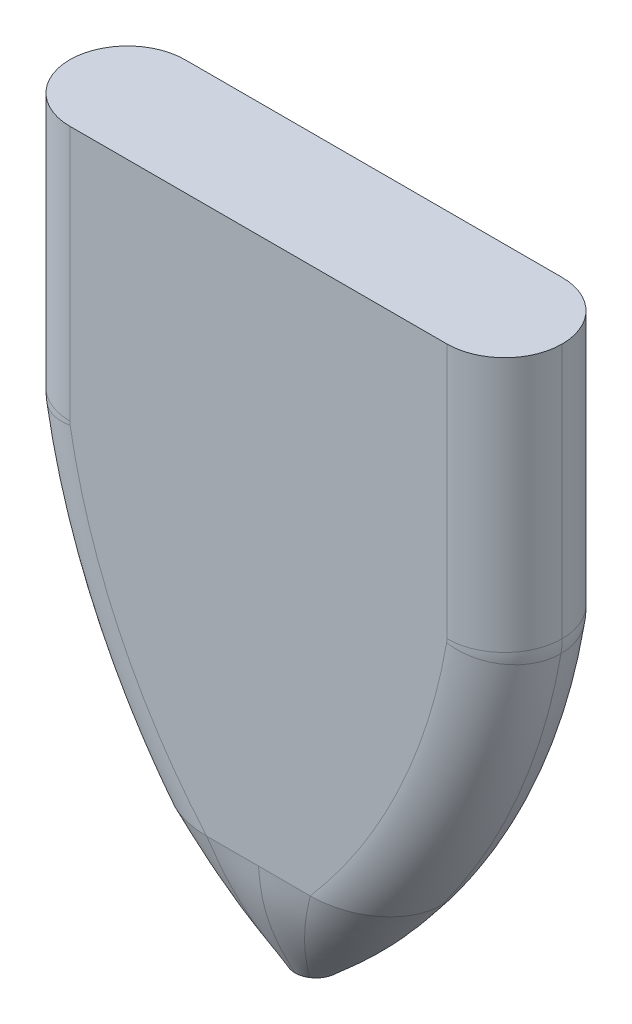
ISO-10303-21;
HEADER;
FILE_DESCRIPTION(('STEP AP214'),'2;1');
FILE_NAME('part.step','',(''),(''),'','','');
FILE_SCHEMA(('AUTOMOTIVE_DESIGN { 1 0 10303 214 1 1 1 1 }'));
ENDSEC;
DATA;
#1=APPLICATION_CONTEXT('core data for automotive mechanical design processes');
#2=APPLICATION_PROTOCOL_DEFINITION('international standard','automotive_design',2000,#1);
#3=PRODUCT_CONTEXT('',#1,'mechanical');
#4=PRODUCT('Part','Part','',(#3));
#5=PRODUCT_RELATED_PRODUCT_CATEGORY('part','',(#4));
#6=PRODUCT_DEFINITION_FORMATION('','',#4);
#7=PRODUCT_DEFINITION_CONTEXT('part definition',#1,'design');
#8=PRODUCT_DEFINITION('design','',#6,#7);
#9=PRODUCT_DEFINITION_SHAPE('','',#8);
#10=(LENGTH_UNIT() NAMED_UNIT(*) SI_UNIT(.MILLI.,.METRE.));
#11=(NAMED_UNIT(*) PLANE_ANGLE_UNIT() SI_UNIT($,.RADIAN.));
#12=(NAMED_UNIT(*) SI_UNIT($,.STERADIAN.) SOLID_ANGLE_UNIT());
#13=UNCERTAINTY_MEASURE_WITH_UNIT(LENGTH_MEASURE(1.E-05),#10,'distance_accuracy_value','');
#14=(GEOMETRIC_REPRESENTATION_CONTEXT(3) GLOBAL_UNCERTAINTY_ASSIGNED_CONTEXT((#13)) GLOBAL_UNIT_ASSIGNED_CONTEXT((#10,
#11,#12)) REPRESENTATION_CONTEXT('',''));
#15=CARTESIAN_POINT('',(0.,0.,0.));
#16=DIRECTION('',(0.,0.,1.));
#17=DIRECTION('',(1.,0.,0.));
#18=AXIS2_PLACEMENT_3D('',#15,#16,#17);
#19=CARTESIAN_POINT('',(-47.,125.5,11.));
#20=DIRECTION('',(0.,1.,0.));
#21=DIRECTION('',(0.,0.,1.));
#22=AXIS2_PLACEMENT_3D('',#19,#20,#21);
#23=PLANE('',#22);
#24=CARTESIAN_POINT('',(36.,125.5,0.));
#25=DIRECTION('',(0.,1.,0.));
#26=DIRECTION('',(0.,0.,1.));
#27=AXIS2_PLACEMENT_3D('',#24,#25,#26);
#28=CIRCLE('',#27,11.);
#29=CARTESIAN_POINT('',(36.,125.5,11.));
#30=VERTEX_POINT('',#29);
#31=CARTESIAN_POINT('',(47.,125.5,0.));
#32=VERTEX_POINT('',#31);
#33=EDGE_CURVE('E527',#30,#32,#28,.T.);
#34=ORIENTED_EDGE('',*,*,#33,.T.);
#35=CARTESIAN_POINT('',(36.,125.5,0.));
#36=DIRECTION('',(0.,1.,0.));
#37=DIRECTION('',(0.,0.,1.));
#38=AXIS2_PLACEMENT_3D('',#35,#36,#37);
#39=CIRCLE('',#38,11.);
#40=CARTESIAN_POINT('',(36.,125.5,-11.));
#41=VERTEX_POINT('',#40);
#42=EDGE_CURVE('E12',#32,#41,#39,.T.);
#43=ORIENTED_EDGE('',*,*,#42,.T.);
#44=DIRECTION('',(1.,0.,0.));
#45=VECTOR('',#44,1.);
#46=CARTESIAN_POINT('',(-47.,125.5,-11.));
#47=LINE('',#46,#45);
#48=CARTESIAN_POINT('',(-36.,125.5,-11.));
#49=VERTEX_POINT('',#48);
#50=EDGE_CURVE('E651',#49,#41,#47,.T.);
#51=ORIENTED_EDGE('',*,*,#50,.F.);
#52=CARTESIAN_POINT('',(-36.,125.5,0.));
#53=DIRECTION('',(0.,1.,0.));
#54=DIRECTION('',(0.,0.,1.));
#55=AXIS2_PLACEMENT_3D('',#52,#53,#54);
#56=CIRCLE('',#55,11.);
#57=CARTESIAN_POINT('',(-47.,125.5,0.));
#58=VERTEX_POINT('',#57);
#59=EDGE_CURVE('E543',#49,#58,#56,.T.);
#60=ORIENTED_EDGE('',*,*,#59,.T.);
#61=CARTESIAN_POINT('',(-36.,125.5,0.));
#62=DIRECTION('',(0.,1.,0.));
#63=DIRECTION('',(0.,0.,1.));
#64=AXIS2_PLACEMENT_3D('',#61,#62,#63);
#65=CIRCLE('',#64,11.);
#66=CARTESIAN_POINT('',(-36.,125.5,11.));
#67=VERTEX_POINT('',#66);
#68=EDGE_CURVE('E879',#58,#67,#65,.T.);
#69=ORIENTED_EDGE('',*,*,#68,.T.);
#70=DIRECTION('',(1.,0.,0.));
#71=VECTOR('',#70,1.);
#72=CARTESIAN_POINT('',(-47.,125.5,11.));
#73=LINE('',#72,#71);
#74=EDGE_CURVE('E860',#67,#30,#73,.T.);
#75=ORIENTED_EDGE('',*,*,#74,.T.);
#76=EDGE_LOOP('',(#34,#43,#51,#60,#69,#75));
#77=FACE_BOUND('',#76,.T.);
#78=ADVANCED_FACE('F519',(#77),#23,.T.);
#79=CARTESIAN_POINT('',(-76.3478497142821,95.7560601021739,11.));
#80=DIRECTION('',(0.,0.,-1.));
#81=DIRECTION('',(-1.,0.,0.));
#82=AXIS2_PLACEMENT_3D('',#79,#80,#81);
#83=PLANE('',#82);
#84=DIRECTION('',(1.,0.,0.));
#85=VECTOR('',#84,1.);
#86=CARTESIAN_POINT('',(-23.9835705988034,21.2,11.));
#87=LINE('',#86,#85);
#88=CARTESIAN_POINT('',(-9.89247671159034,21.2,11.));
#89=VERTEX_POINT('',#88);
#90=CARTESIAN_POINT('',(0.,21.2,11.));
#91=VERTEX_POINT('',#90);
#92=EDGE_CURVE('E535',#89,#91,#87,.T.);
#93=ORIENTED_EDGE('',*,*,#92,.T.);
#94=DIRECTION('',(-1.,0.,0.));
#95=VECTOR('',#94,1.);
#96=CARTESIAN_POINT('',(4.94623835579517,21.2,11.));
#97=LINE('',#96,#95);
#98=CARTESIAN_POINT('',(9.89247671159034,21.2,11.));
#99=VERTEX_POINT('',#98);
#100=EDGE_CURVE('E733',#99,#91,#97,.T.);
#101=ORIENTED_EDGE('',*,*,#100,.F.);
#102=CARTESIAN_POINT('',(-76.3478497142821,95.7560601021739,11.));
#103=DIRECTION('',(0.,0.,-1.));
#104=DIRECTION('',(-1.,0.,0.));
#105=AXIS2_PLACEMENT_3D('',#102,#103,#104);
#106=CIRCLE('',#105,114.);
#107=CARTESIAN_POINT('',(35.9399218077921,76.0721487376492,11.));
#108=VERTEX_POINT('',#107);
#109=EDGE_CURVE('E878',#99,#108,#106,.F.);
#110=ORIENTED_EDGE('',*,*,#109,.T.);
#111=CARTESIAN_POINT('',(32.,76.7628122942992,11.));
#112=DIRECTION('',(0.,0.,-1.));
#113=DIRECTION('',(-1.,0.,0.));
#114=AXIS2_PLACEMENT_3D('',#111,#112,#113);
#115=CIRCLE('',#114,3.99999999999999);
#116=CARTESIAN_POINT('',(36.,76.7628122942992,11.));
#117=VERTEX_POINT('',#116);
#118=EDGE_CURVE('E876',#108,#117,#115,.F.);
#119=ORIENTED_EDGE('',*,*,#118,.T.);
#120=DIRECTION('',(0.,-1.,0.));
#121=VECTOR('',#120,1.);
#122=CARTESIAN_POINT('',(36.,125.5,11.));
#123=LINE('',#122,#121);
#124=EDGE_CURVE('E874',#117,#30,#123,.F.);
#125=ORIENTED_EDGE('',*,*,#124,.T.);
#126=ORIENTED_EDGE('',*,*,#74,.F.);
#127=DIRECTION('',(0.,-1.,0.));
#128=VECTOR('',#127,1.);
#129=CARTESIAN_POINT('',(-36.,95.7560601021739,11.));
#130=LINE('',#129,#128);
#131=CARTESIAN_POINT('',(-36.,76.7628122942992,11.));
#132=VERTEX_POINT('',#131);
#133=EDGE_CURVE('E639',#67,#132,#130,.T.);
#134=ORIENTED_EDGE('',*,*,#133,.T.);
#135=CARTESIAN_POINT('',(-32.,76.7628122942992,11.));
#136=DIRECTION('',(0.,0.,-1.));
#137=DIRECTION('',(-1.,0.,0.));
#138=AXIS2_PLACEMENT_3D('',#135,#136,#137);
#139=CIRCLE('',#138,3.99999999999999);
#140=CARTESIAN_POINT('',(-35.9399218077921,76.0721487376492,11.));
#141=VERTEX_POINT('',#140);
#142=EDGE_CURVE('E871',#132,#141,#139,.F.);
#143=ORIENTED_EDGE('',*,*,#142,.T.);
#144=CARTESIAN_POINT('',(76.3478497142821,95.7560601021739,11.));
#145=DIRECTION('',(0.,0.,-1.));
#146=DIRECTION('',(-1.,0.,0.));
#147=AXIS2_PLACEMENT_3D('',#144,#145,#146);
#148=CIRCLE('',#147,114.);
#149=EDGE_CURVE('E873',#141,#89,#148,.F.);
#150=ORIENTED_EDGE('',*,*,#149,.T.);
#151=EDGE_LOOP('',(#93,#101,#110,#119,#125,#126,#134,#143,#150));
#152=FACE_BOUND('',#151,.T.);
#153=ADVANCED_FACE('F961',(#152),#83,.F.);
#154=CARTESIAN_POINT('',(-76.3478497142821,95.7560601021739,-11.));
#155=DIRECTION('',(0.,0.,-1.));
#156=DIRECTION('',(-1.,0.,0.));
#157=AXIS2_PLACEMENT_3D('',#154,#155,#156);
#158=PLANE('',#157);
#159=DIRECTION('',(1.,0.,0.));
#160=VECTOR('',#159,1.);
#161=CARTESIAN_POINT('',(-23.9835705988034,21.2,-11.));
#162=LINE('',#161,#160);
#163=CARTESIAN_POINT('',(-9.89247671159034,21.2,-11.));
#164=VERTEX_POINT('',#163);
#165=CARTESIAN_POINT('',(9.89247671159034,21.2,-11.));
#166=VERTEX_POINT('',#165);
#167=EDGE_CURVE('E643',#164,#166,#162,.T.);
#168=ORIENTED_EDGE('',*,*,#167,.F.);
#169=CARTESIAN_POINT('',(76.3478497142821,95.7560601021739,-11.));
#170=DIRECTION('',(0.,0.,-1.));
#171=DIRECTION('',(-1.,0.,0.));
#172=AXIS2_PLACEMENT_3D('',#169,#170,#171);
#173=CIRCLE('',#172,114.);
#174=CARTESIAN_POINT('',(-35.9399218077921,76.0721487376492,-11.));
#175=VERTEX_POINT('',#174);
#176=EDGE_CURVE('E627',#164,#175,#173,.T.);
#177=ORIENTED_EDGE('',*,*,#176,.T.);
#178=CARTESIAN_POINT('',(-32.,76.7628122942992,-11.));
#179=DIRECTION('',(0.,0.,-1.));
#180=DIRECTION('',(-1.,0.,0.));
#181=AXIS2_PLACEMENT_3D('',#178,#179,#180);
#182=CIRCLE('',#181,3.99999999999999);
#183=CARTESIAN_POINT('',(-36.,76.7628122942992,-11.));
#184=VERTEX_POINT('',#183);
#185=EDGE_CURVE('E640',#175,#184,#182,.T.);
#186=ORIENTED_EDGE('',*,*,#185,.T.);
#187=DIRECTION('',(0.,-1.,0.));
#188=VECTOR('',#187,1.);
#189=CARTESIAN_POINT('',(-36.,125.5,-11.));
#190=LINE('',#189,#188);
#191=EDGE_CURVE('E867',#184,#49,#190,.F.);
#192=ORIENTED_EDGE('',*,*,#191,.T.);
#193=ORIENTED_EDGE('',*,*,#50,.T.);
#194=DIRECTION('',(0.,-1.,0.));
#195=VECTOR('',#194,1.);
#196=CARTESIAN_POINT('',(36.,95.7560601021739,-11.));
#197=LINE('',#196,#195);
#198=CARTESIAN_POINT('',(36.,76.7628122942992,-11.));
#199=VERTEX_POINT('',#198);
#200=EDGE_CURVE('E863',#41,#199,#197,.T.);
#201=ORIENTED_EDGE('',*,*,#200,.T.);
#202=CARTESIAN_POINT('',(32.,76.7628122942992,-11.));
#203=DIRECTION('',(0.,0.,-1.));
#204=DIRECTION('',(-1.,0.,0.));
#205=AXIS2_PLACEMENT_3D('',#202,#203,#204);
#206=CIRCLE('',#205,3.99999999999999);
#207=CARTESIAN_POINT('',(35.9399218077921,76.0721487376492,-11.));
#208=VERTEX_POINT('',#207);
#209=EDGE_CURVE('E865',#199,#208,#206,.T.);
#210=ORIENTED_EDGE('',*,*,#209,.T.);
#211=CARTESIAN_POINT('',(-76.3478497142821,95.7560601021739,-11.));
#212=DIRECTION('',(0.,0.,-1.));
#213=DIRECTION('',(-1.,0.,0.));
#214=AXIS2_PLACEMENT_3D('',#211,#212,#213);
#215=CIRCLE('',#214,114.);
#216=EDGE_CURVE('E646',#208,#166,#215,.T.);
#217=ORIENTED_EDGE('',*,*,#216,.T.);
#218=EDGE_LOOP('',(#168,#177,#186,#192,#193,#201,#210,#217));
#219=FACE_BOUND('',#218,.T.);
#220=ADVANCED_FACE('F644',(#219),#158,.T.);
#221=CARTESIAN_POINT('',(-36.,95.7560601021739,0.));
#222=DIRECTION('',(0.,-1.,0.));
#223=DIRECTION('',(1.,0.,0.));
#224=AXIS2_PLACEMENT_3D('',#221,#222,#223);
#225=CYLINDRICAL_SURFACE('',#224,11.);
#226=ORIENTED_EDGE('',*,*,#133,.F.);
#227=ORIENTED_EDGE('',*,*,#68,.F.);
#228=DIRECTION('',(0.,-1.,0.));
#229=VECTOR('',#228,1.);
#230=CARTESIAN_POINT('',(-47.,125.5,0.));
#231=LINE('',#230,#229);
#232=CARTESIAN_POINT('',(-47.,76.7628122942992,0.));
#233=VERTEX_POINT('',#232);
#234=EDGE_CURVE('E652',#233,#58,#231,.F.);
#235=ORIENTED_EDGE('',*,*,#234,.F.);
#236=CARTESIAN_POINT('',(-36.,76.7628122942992,0.));
#237=DIRECTION('',(0.,-1.,0.));
#238=DIRECTION('',(0.,0.,-1.));
#239=AXIS2_PLACEMENT_3D('',#236,#237,#238);
#240=CIRCLE('',#239,11.);
#241=EDGE_CURVE('E853',#132,#233,#240,.T.);
#242=ORIENTED_EDGE('',*,*,#241,.F.);
#243=EDGE_LOOP('',(#226,#227,#235,#242));
#244=FACE_BOUND('',#243,.T.);
#245=ADVANCED_FACE('F955',(#244),#225,.T.);
#246=CARTESIAN_POINT('',(-36.,125.5,0.));
#247=DIRECTION('',(0.,1.,0.));
#248=DIRECTION('',(-1.,0.,0.));
#249=AXIS2_PLACEMENT_3D('',#246,#247,#248);
#250=CYLINDRICAL_SURFACE('',#249,11.);
#251=ORIENTED_EDGE('',*,*,#59,.F.);
#252=ORIENTED_EDGE('',*,*,#191,.F.);
#253=CARTESIAN_POINT('',(-36.,76.7628122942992,0.));
#254=DIRECTION('',(0.,-1.,0.));
#255=DIRECTION('',(0.,0.,-1.));
#256=AXIS2_PLACEMENT_3D('',#253,#254,#255);
#257=CIRCLE('',#256,11.);
#258=EDGE_CURVE('E850',#233,#184,#257,.T.);
#259=ORIENTED_EDGE('',*,*,#258,.F.);
#260=ORIENTED_EDGE('',*,*,#234,.T.);
#261=EDGE_LOOP('',(#251,#252,#259,#260));
#262=FACE_BOUND('',#261,.T.);
#263=ADVANCED_FACE('F951',(#262),#250,.T.);
#264=CARTESIAN_POINT('',(-32.,76.7628122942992,0.));
#265=DIRECTION('',(0.,0.,-1.));
#266=DIRECTION('',(-1.,0.,0.));
#267=AXIS2_PLACEMENT_3D('',#264,#265,#266);
#268=DEGENERATE_TOROIDAL_SURFACE('',#267,3.99999999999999,11.,.T.);
#269=ORIENTED_EDGE('',*,*,#142,.F.);
#270=ORIENTED_EDGE('',*,*,#241,.T.);
#271=CARTESIAN_POINT('',(-32.,76.7628122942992,0.));
#272=DIRECTION('',(0.,0.,-1.));
#273=DIRECTION('',(-1.,0.,0.));
#274=AXIS2_PLACEMENT_3D('',#271,#272,#273);
#275=CIRCLE('',#274,15.);
#276=CARTESIAN_POINT('',(-46.7747067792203,74.1728239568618,0.));
#277=VERTEX_POINT('',#276);
#278=EDGE_CURVE('E847',#277,#233,#275,.T.);
#279=ORIENTED_EDGE('',*,*,#278,.F.);
#280=CARTESIAN_POINT('',(-35.9399218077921,76.0721487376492,0.));
#281=DIRECTION('',(0.172665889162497,-0.984980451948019,0.));
#282=DIRECTION('',(0.984980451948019,0.172665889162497,0.));
#283=AXIS2_PLACEMENT_3D('',#280,#281,#282);
#284=CIRCLE('',#283,11.);
#285=EDGE_CURVE('E844',#141,#277,#284,.T.);
#286=ORIENTED_EDGE('',*,*,#285,.F.);
#287=EDGE_LOOP('',(#269,#270,#279,#286));
#288=FACE_BOUND('',#287,.T.);
#289=ADVANCED_FACE('F947',(#288),#268,.T.);
#290=CARTESIAN_POINT('',(-32.,76.7628122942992,0.));
#291=DIRECTION('',(0.,0.,-1.));
#292=DIRECTION('',(-1.,0.,0.));
#293=AXIS2_PLACEMENT_3D('',#290,#291,#292);
#294=DEGENERATE_TOROIDAL_SURFACE('',#293,3.99999999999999,11.,.T.);
#295=ORIENTED_EDGE('',*,*,#258,.T.);
#296=ORIENTED_EDGE('',*,*,#185,.F.);
#297=CARTESIAN_POINT('',(-35.9399218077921,76.0721487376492,0.));
#298=DIRECTION('',(0.172665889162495,-0.98498045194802,0.));
#299=DIRECTION('',(0.98498045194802,0.172665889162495,0.));
#300=AXIS2_PLACEMENT_3D('',#297,#298,#299);
#301=CIRCLE('',#300,11.);
#302=EDGE_CURVE('E636',#277,#175,#301,.T.);
#303=ORIENTED_EDGE('',*,*,#302,.F.);
#304=ORIENTED_EDGE('',*,*,#278,.T.);
#305=EDGE_LOOP('',(#295,#296,#303,#304));
#306=FACE_BOUND('',#305,.T.);
#307=ADVANCED_FACE('F942',(#306),#294,.T.);
#308=CARTESIAN_POINT('',(76.3478497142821,95.7560601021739,0.));
#309=DIRECTION('',(0.,0.,-1.));
#310=DIRECTION('',(-1.,0.,0.));
#311=AXIS2_PLACEMENT_3D('',#308,#309,#310);
#312=TOROIDAL_SURFACE('',#311,114.,11.);
#313=ORIENTED_EDGE('',*,*,#149,.F.);
#314=ORIENTED_EDGE('',*,*,#285,.T.);
#315=CARTESIAN_POINT('',(76.3478497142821,95.7560601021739,0.));
#316=DIRECTION('',(0.,0.,-1.));
#317=DIRECTION('',(-1.,0.,0.));
#318=AXIS2_PLACEMENT_3D('',#315,#316,#317);
#319=CIRCLE('',#318,125.);
#320=CARTESIAN_POINT('',(-23.9835705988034,21.2,0.));
#321=VERTEX_POINT('',#320);
#322=EDGE_CURVE('E842',#321,#277,#319,.T.);
#323=ORIENTED_EDGE('',*,*,#322,.F.);
#324=CARTESIAN_POINT('',(-9.89247671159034,21.2,11.));
#325=CARTESIAN_POINT('',(-10.7230369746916,21.2,11.));
#326=CARTESIAN_POINT('',(-11.5454341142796,21.2,10.946537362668));
#327=CARTESIAN_POINT('',(-13.1735878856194,21.2,10.7306286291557));
#328=CARTESIAN_POINT('',(-13.9793576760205,21.2,10.5682687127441));
#329=CARTESIAN_POINT('',(-15.1741864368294,21.2,10.2341788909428));
#330=CARTESIAN_POINT('',(-15.571418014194,21.2,10.1070809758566));
#331=CARTESIAN_POINT('',(-16.3490375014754,21.2,9.82441507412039));
#332=CARTESIAN_POINT('',(-16.7305553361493,21.2,9.66863843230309));
#333=CARTESIAN_POINT('',(-17.8523868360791,21.2,9.15630114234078));
#334=CARTESIAN_POINT('',(-18.5702612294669,21.2,8.7552931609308));
#335=CARTESIAN_POINT('',(-19.5945920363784,21.2,8.04982813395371));
#336=CARTESIAN_POINT('',(-19.9272756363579,21.2,7.79681183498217));
#337=CARTESIAN_POINT('',(-20.5593468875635,21.2,7.26404191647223));
#338=CARTESIAN_POINT('',(-20.8605775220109,21.2,6.98312245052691));
#339=CARTESIAN_POINT('',(-21.4317139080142,21.2,6.39053093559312));
#340=CARTESIAN_POINT('',(-21.7016335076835,21.2,6.07887248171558));
#341=CARTESIAN_POINT('',(-22.2072382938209,21.2,5.42194661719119));
#342=CARTESIAN_POINT('',(-22.4434127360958,21.2,5.07517524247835));
#343=CARTESIAN_POINT('',(-23.0764925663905,21.2,4.01070997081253));
#344=CARTESIAN_POINT('',(-23.4063989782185,21.2,3.26085550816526));
#345=CARTESIAN_POINT('',(-23.7483785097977,21.2,2.06936012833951));
#346=CARTESIAN_POINT('',(-23.8367678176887,21.2,1.65832833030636));
#347=CARTESIAN_POINT('',(-23.9539325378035,21.2,0.833714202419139));
#348=CARTESIAN_POINT('',(-23.9835705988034,21.2,0.418397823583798));
#349=CARTESIAN_POINT('',(-23.9835705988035,21.2,0.));
#350=CARTESIAN_POINT('',(-23.9835705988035,21.2,-0.835508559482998));
#351=CARTESIAN_POINT('',(-23.8666028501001,21.2,-1.65000868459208));
#352=CARTESIAN_POINT('',(-23.5275362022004,21.2,-2.84237217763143));
#353=CARTESIAN_POINT('',(-23.3856176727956,21.2,-3.23734246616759));
#354=CARTESIAN_POINT('',(-23.055122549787,21.2,-3.99709795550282));
#355=CARTESIAN_POINT('',(-22.866401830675,21.2,-4.36374467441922));
#356=CARTESIAN_POINT('',(-22.4452046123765,21.2,-5.0723744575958));
#357=CARTESIAN_POINT('',(-22.2127128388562,21.2,-5.41434891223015));
#358=CARTESIAN_POINT('',(-21.7054088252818,21.2,-6.07444320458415));
#359=CARTESIAN_POINT('',(-21.4332798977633,21.2,-6.38886438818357));
#360=CARTESIAN_POINT('',(-20.8601335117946,21.2,-6.98362478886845));
#361=CARTESIAN_POINT('',(-20.5583482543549,21.2,-7.26493861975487));
#362=CARTESIAN_POINT('',(-19.92634730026,21.2,-7.79753919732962));
#363=CARTESIAN_POINT('',(-19.5947332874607,21.2,-8.04974875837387));
#364=CARTESIAN_POINT('',(-18.568814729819,21.2,-8.75625353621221));
#365=CARTESIAN_POINT('',(-17.8509677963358,21.2,-9.15696122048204));
#366=CARTESIAN_POINT('',(-16.7309913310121,21.2,-9.66843330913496));
#367=CARTESIAN_POINT('',(-16.3503940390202,21.2,-9.82384564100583));
#368=CARTESIAN_POINT('',(-15.5752575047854,21.2,-10.1057611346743));
#369=CARTESIAN_POINT('',(-15.1792907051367,21.2,-10.2326386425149));
#370=CARTESIAN_POINT('',(-13.9818180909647,21.2,-10.5678050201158));
#371=CARTESIAN_POINT('',(-13.1748244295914,21.2,-10.7304402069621));
#372=CARTESIAN_POINT('',(-11.5452627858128,21.2,-10.9465845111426));
#373=CARTESIAN_POINT('',(-10.7226814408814,21.2,-11.));
#374=CARTESIAN_POINT('',(-9.89247671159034,21.2,-11.));
#375=B_SPLINE_CURVE_WITH_KNOTS('',3,(#324,#325,#326,#327,#328,#329,#330,#331,#332,#333,#334,
#335,#336,#337,#338,#339,#340,#341,#342,#343,#344,#345,#346,#347,#348,#349,#350,#351,#352,#353,
#354,#355,#356,#357,#358,#359,#360,#361,#362,#363,#364,#365,#366,#367,#368,#369,#370,#371,#372,
#373,#374),.UNSPECIFIED.,.F.,.F.,(4,2,2,2,2,2,2,2,2,2,2,2,3,2,2,2,2,2,2,2,2,2,2,2,4),(0.125,
0.140625,0.15625,0.1640625,0.171875,0.1875,0.1953125,0.203125,0.2109375,0.21875,0.234375,
0.2421875,0.25,0.265625,0.2734375,0.28125,0.2890625,0.296875,0.3046875,0.3125,0.328125,
0.3359375,0.34375,0.359375,0.375),.UNSPECIFIED.);
#376=EDGE_CURVE('E662',#89,#321,#375,.T.);
#377=ORIENTED_EDGE('',*,*,#376,.F.);
#378=EDGE_LOOP('',(#313,#314,#323,#377));
#379=FACE_BOUND('',#378,.T.);
#380=ADVANCED_FACE('F932',(#379),#312,.T.);
#381=CARTESIAN_POINT('',(76.3478497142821,95.7560601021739,0.));
#382=DIRECTION('',(0.,0.,-1.));
#383=DIRECTION('',(-1.,0.,0.));
#384=AXIS2_PLACEMENT_3D('',#381,#382,#383);
#385=TOROIDAL_SURFACE('',#384,114.,11.);
#386=ORIENTED_EDGE('',*,*,#302,.T.);
#387=ORIENTED_EDGE('',*,*,#176,.F.);
#388=CARTESIAN_POINT('',(-9.89247671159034,21.2,11.));
#389=CARTESIAN_POINT('',(-10.7230369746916,21.2,11.));
#390=CARTESIAN_POINT('',(-11.5454341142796,21.2,10.946537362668));
#391=CARTESIAN_POINT('',(-13.1735878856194,21.2,10.7306286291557));
#392=CARTESIAN_POINT('',(-13.9793576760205,21.2,10.5682687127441));
#393=CARTESIAN_POINT('',(-15.1741864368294,21.2,10.2341788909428));
#394=CARTESIAN_POINT('',(-15.571418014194,21.2,10.1070809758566));
#395=CARTESIAN_POINT('',(-16.3490375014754,21.2,9.82441507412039));
#396=CARTESIAN_POINT('',(-16.7305553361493,21.2,9.66863843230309));
#397=CARTESIAN_POINT('',(-17.8523868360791,21.2,9.15630114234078));
#398=CARTESIAN_POINT('',(-18.5702612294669,21.2,8.7552931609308));
#399=CARTESIAN_POINT('',(-19.5945920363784,21.2,8.04982813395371));
#400=CARTESIAN_POINT('',(-19.9272756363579,21.2,7.79681183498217));
#401=CARTESIAN_POINT('',(-20.5593468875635,21.2,7.26404191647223));
#402=CARTESIAN_POINT('',(-20.8605775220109,21.2,6.98312245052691));
#403=CARTESIAN_POINT('',(-21.4317139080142,21.2,6.39053093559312));
#404=CARTESIAN_POINT('',(-21.7016335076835,21.2,6.07887248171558));
#405=CARTESIAN_POINT('',(-22.2072382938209,21.2,5.42194661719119));
#406=CARTESIAN_POINT('',(-22.4434127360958,21.2,5.07517524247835));
#407=CARTESIAN_POINT('',(-23.0764925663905,21.2,4.01070997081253));
#408=CARTESIAN_POINT('',(-23.4063989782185,21.2,3.26085550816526));
#409=CARTESIAN_POINT('',(-23.7483785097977,21.2,2.06936012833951));
#410=CARTESIAN_POINT('',(-23.8367678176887,21.2,1.65832833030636));
#411=CARTESIAN_POINT('',(-23.9539325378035,21.2,0.833714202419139));
#412=CARTESIAN_POINT('',(-23.9835705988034,21.2,0.418397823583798));
#413=CARTESIAN_POINT('',(-23.9835705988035,21.2,0.));
#414=CARTESIAN_POINT('',(-23.9835705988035,21.2,-0.835508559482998));
#415=CARTESIAN_POINT('',(-23.8666028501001,21.2,-1.65000868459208));
#416=CARTESIAN_POINT('',(-23.5275362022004,21.2,-2.84237217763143));
#417=CARTESIAN_POINT('',(-23.3856176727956,21.2,-3.23734246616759));
#418=CARTESIAN_POINT('',(-23.055122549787,21.2,-3.99709795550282));
#419=CARTESIAN_POINT('',(-22.866401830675,21.2,-4.36374467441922));
#420=CARTESIAN_POINT('',(-22.4452046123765,21.2,-5.0723744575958));
#421=CARTESIAN_POINT('',(-22.2127128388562,21.2,-5.41434891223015));
#422=CARTESIAN_POINT('',(-21.7054088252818,21.2,-6.07444320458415));
#423=CARTESIAN_POINT('',(-21.4332798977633,21.2,-6.38886438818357));
#424=CARTESIAN_POINT('',(-20.8601335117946,21.2,-6.98362478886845));
#425=CARTESIAN_POINT('',(-20.5583482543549,21.2,-7.26493861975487));
#426=CARTESIAN_POINT('',(-19.92634730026,21.2,-7.79753919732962));
#427=CARTESIAN_POINT('',(-19.5947332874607,21.2,-8.04974875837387));
#428=CARTESIAN_POINT('',(-18.568814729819,21.2,-8.75625353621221));
#429=CARTESIAN_POINT('',(-17.8509677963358,21.2,-9.15696122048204));
#430=CARTESIAN_POINT('',(-16.7309913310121,21.2,-9.66843330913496));
#431=CARTESIAN_POINT('',(-16.3503940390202,21.2,-9.82384564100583));
#432=CARTESIAN_POINT('',(-15.5752575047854,21.2,-10.1057611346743));
#433=CARTESIAN_POINT('',(-15.1792907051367,21.2,-10.2326386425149));
#434=CARTESIAN_POINT('',(-13.9818180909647,21.2,-10.5678050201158));
#435=CARTESIAN_POINT('',(-13.1748244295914,21.2,-10.7304402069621));
#436=CARTESIAN_POINT('',(-11.5452627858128,21.2,-10.9465845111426));
#437=CARTESIAN_POINT('',(-10.7226814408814,21.2,-11.));
#438=CARTESIAN_POINT('',(-9.89247671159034,21.2,-11.));
#439=B_SPLINE_CURVE_WITH_KNOTS('',3,(#388,#389,#390,#391,#392,#393,#394,#395,#396,#397,#398,
#399,#400,#401,#402,#403,#404,#405,#406,#407,#408,#409,#410,#411,#412,#413,#414,#415,#416,#417,
#418,#419,#420,#421,#422,#423,#424,#425,#426,#427,#428,#429,#430,#431,#432,#433,#434,#435,#436,
#437,#438),.UNSPECIFIED.,.F.,.F.,(4,2,2,2,2,2,2,2,2,2,2,2,3,2,2,2,2,2,2,2,2,2,2,2,4),(0.125,
0.140625,0.15625,0.1640625,0.171875,0.1875,0.1953125,0.203125,0.2109375,0.21875,0.234375,
0.2421875,0.25,0.265625,0.2734375,0.28125,0.2890625,0.296875,0.3046875,0.3125,0.328125,
0.3359375,0.34375,0.359375,0.375),.UNSPECIFIED.);
#440=EDGE_CURVE('E632',#321,#164,#439,.T.);
#441=ORIENTED_EDGE('',*,*,#440,.F.);
#442=ORIENTED_EDGE('',*,*,#322,.T.);
#443=EDGE_LOOP('',(#386,#387,#441,#442));
#444=FACE_BOUND('',#443,.T.);
#445=ADVANCED_FACE('F629',(#444),#385,.T.);
#446=CARTESIAN_POINT('',(36.,125.5,0.));
#447=DIRECTION('',(0.,1.,0.));
#448=DIRECTION('',(0.,0.,1.));
#449=AXIS2_PLACEMENT_3D('',#446,#447,#448);
#450=CYLINDRICAL_SURFACE('',#449,11.);
#451=ORIENTED_EDGE('',*,*,#33,.F.);
#452=ORIENTED_EDGE('',*,*,#124,.F.);
#453=CARTESIAN_POINT('',(36.,76.7628122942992,0.));
#454=DIRECTION('',(0.,-1.,0.));
#455=DIRECTION('',(0.,0.,-1.));
#456=AXIS2_PLACEMENT_3D('',#453,#454,#455);
#457=CIRCLE('',#456,11.);
#458=CARTESIAN_POINT('',(47.,76.7628122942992,0.));
#459=VERTEX_POINT('',#458);
#460=EDGE_CURVE('E839',#459,#117,#457,.T.);
#461=ORIENTED_EDGE('',*,*,#460,.F.);
#462=DIRECTION('',(0.,-1.,0.));
#463=VECTOR('',#462,1.);
#464=CARTESIAN_POINT('',(47.,76.7628122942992,0.));
#465=LINE('',#464,#463);
#466=EDGE_CURVE('E836',#32,#459,#465,.T.);
#467=ORIENTED_EDGE('',*,*,#466,.F.);
#468=EDGE_LOOP('',(#451,#452,#461,#467));
#469=FACE_BOUND('',#468,.T.);
#470=ADVANCED_FACE('F974',(#469),#450,.T.);
#471=CARTESIAN_POINT('',(32.,76.7628122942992,0.));
#472=DIRECTION('',(0.,0.,-1.));
#473=DIRECTION('',(-1.,0.,0.));
#474=AXIS2_PLACEMENT_3D('',#471,#472,#473);
#475=DEGENERATE_TOROIDAL_SURFACE('',#474,3.99999999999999,11.,.T.);
#476=ORIENTED_EDGE('',*,*,#460,.T.);
#477=ORIENTED_EDGE('',*,*,#118,.F.);
#478=CARTESIAN_POINT('',(35.9399218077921,76.0721487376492,0.));
#479=DIRECTION('',(-0.172665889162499,-0.984980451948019,0.));
#480=DIRECTION('',(0.984980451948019,-0.172665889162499,0.));
#481=AXIS2_PLACEMENT_3D('',#478,#479,#480);
#482=CIRCLE('',#481,11.);
#483=CARTESIAN_POINT('',(46.7747067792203,74.1728239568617,0.));
#484=VERTEX_POINT('',#483);
#485=EDGE_CURVE('E833',#484,#108,#482,.T.);
#486=ORIENTED_EDGE('',*,*,#485,.F.);
#487=CARTESIAN_POINT('',(32.,76.7628122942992,0.));
#488=DIRECTION('',(0.,0.,-1.));
#489=DIRECTION('',(-1.,0.,0.));
#490=AXIS2_PLACEMENT_3D('',#487,#488,#489);
#491=CIRCLE('',#490,15.);
#492=EDGE_CURVE('E830',#459,#484,#491,.T.);
#493=ORIENTED_EDGE('',*,*,#492,.F.);
#494=EDGE_LOOP('',(#476,#477,#486,#493));
#495=FACE_BOUND('',#494,.T.);
#496=ADVANCED_FACE('F989',(#495),#475,.T.);
#497=CARTESIAN_POINT('',(36.,95.7560601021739,0.));
#498=DIRECTION('',(0.,-1.,0.));
#499=DIRECTION('',(0.,0.,-1.));
#500=AXIS2_PLACEMENT_3D('',#497,#498,#499);
#501=CYLINDRICAL_SURFACE('',#500,11.);
#502=ORIENTED_EDGE('',*,*,#42,.F.);
#503=ORIENTED_EDGE('',*,*,#466,.T.);
#504=CARTESIAN_POINT('',(36.,76.7628122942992,0.));
#505=DIRECTION('',(0.,-1.,0.));
#506=DIRECTION('',(0.,0.,-1.));
#507=AXIS2_PLACEMENT_3D('',#504,#505,#506);
#508=CIRCLE('',#507,11.);
#509=EDGE_CURVE('E827',#199,#459,#508,.T.);
#510=ORIENTED_EDGE('',*,*,#509,.F.);
#511=ORIENTED_EDGE('',*,*,#200,.F.);
#512=EDGE_LOOP('',(#502,#503,#510,#511));
#513=FACE_BOUND('',#512,.T.);
#514=ADVANCED_FACE('F906',(#513),#501,.T.);
#515=CARTESIAN_POINT('',(-76.3478497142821,95.7560601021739,0.));
#516=DIRECTION('',(0.,0.,-1.));
#517=DIRECTION('',(-1.,0.,0.));
#518=AXIS2_PLACEMENT_3D('',#515,#516,#517);
#519=TOROIDAL_SURFACE('',#518,114.,11.);
#520=ORIENTED_EDGE('',*,*,#109,.F.);
#521=CARTESIAN_POINT('',(9.89247671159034,21.2,-11.));
#522=CARTESIAN_POINT('',(10.7226814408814,21.2,-11.));
#523=CARTESIAN_POINT('',(11.5452627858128,21.2,-10.9465845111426));
#524=CARTESIAN_POINT('',(13.1748244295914,21.2,-10.7304402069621));
#525=CARTESIAN_POINT('',(13.9818180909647,21.2,-10.5678050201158));
#526=CARTESIAN_POINT('',(15.1792907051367,21.2,-10.2326386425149));
#527=CARTESIAN_POINT('',(15.5752575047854,21.2,-10.1057611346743));
#528=CARTESIAN_POINT('',(16.3503940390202,21.2,-9.82384564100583));
#529=CARTESIAN_POINT('',(16.7309913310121,21.2,-9.66843330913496));
#530=CARTESIAN_POINT('',(17.8509677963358,21.2,-9.15696122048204));
#531=CARTESIAN_POINT('',(18.568814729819,21.2,-8.75625353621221));
#532=CARTESIAN_POINT('',(19.5947332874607,21.2,-8.04974875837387));
#533=CARTESIAN_POINT('',(19.92634730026,21.2,-7.79753919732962));
#534=CARTESIAN_POINT('',(20.5583482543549,21.2,-7.26493861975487));
#535=CARTESIAN_POINT('',(20.8601335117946,21.2,-6.98362478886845));
#536=CARTESIAN_POINT('',(21.4332798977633,21.2,-6.38886438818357));
#537=CARTESIAN_POINT('',(21.7054088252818,21.2,-6.07444320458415));
#538=CARTESIAN_POINT('',(22.2127128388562,21.2,-5.41434891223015));
#539=CARTESIAN_POINT('',(22.4452046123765,21.2,-5.0723744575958));
#540=CARTESIAN_POINT('',(22.866401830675,21.2,-4.36374467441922));
#541=CARTESIAN_POINT('',(23.055122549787,21.2,-3.99709795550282));
#542=CARTESIAN_POINT('',(23.3856176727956,21.2,-3.23734246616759));
#543=CARTESIAN_POINT('',(23.5275362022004,21.2,-2.84237217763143));
#544=CARTESIAN_POINT('',(23.8666028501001,21.2,-1.65000868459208));
#545=CARTESIAN_POINT('',(23.9835705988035,21.2,-0.835508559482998));
#546=CARTESIAN_POINT('',(23.9835705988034,21.2,0.));
#547=CARTESIAN_POINT('',(23.9835705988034,21.2,0.418397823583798));
#548=CARTESIAN_POINT('',(23.9539325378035,21.2,0.833714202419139));
#549=CARTESIAN_POINT('',(23.8367678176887,21.2,1.65832833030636));
#550=CARTESIAN_POINT('',(23.7483785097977,21.2,2.06936012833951));
#551=CARTESIAN_POINT('',(23.4063989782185,21.2,3.26085550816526));
#552=CARTESIAN_POINT('',(23.0764925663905,21.2,4.01070997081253));
#553=CARTESIAN_POINT('',(22.4434127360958,21.2,5.07517524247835));
#554=CARTESIAN_POINT('',(22.2072382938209,21.2,5.42194661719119));
#555=CARTESIAN_POINT('',(21.7016335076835,21.2,6.07887248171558));
#556=CARTESIAN_POINT('',(21.4317139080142,21.2,6.39053093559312));
#557=CARTESIAN_POINT('',(20.8605775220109,21.2,6.98312245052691));
#558=CARTESIAN_POINT('',(20.5593468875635,21.2,7.26404191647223));
#559=CARTESIAN_POINT('',(19.9272756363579,21.2,7.79681183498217));
#560=CARTESIAN_POINT('',(19.5945920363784,21.2,8.04982813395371));
#561=CARTESIAN_POINT('',(18.5702612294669,21.2,8.7552931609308));
#562=CARTESIAN_POINT('',(17.8523868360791,21.2,9.15630114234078));
#563=CARTESIAN_POINT('',(16.7305553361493,21.2,9.66863843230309));
#564=CARTESIAN_POINT('',(16.3490375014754,21.2,9.82441507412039));
#565=CARTESIAN_POINT('',(15.571418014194,21.2,10.1070809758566));
#566=CARTESIAN_POINT('',(15.1741864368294,21.2,10.2341788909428));
#567=CARTESIAN_POINT('',(13.9793576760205,21.2,10.5682687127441));
#568=CARTESIAN_POINT('',(13.1735878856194,21.2,10.7306286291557));
#569=CARTESIAN_POINT('',(11.5454341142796,21.2,10.946537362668));
#570=CARTESIAN_POINT('',(10.7230369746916,21.2,11.));
#571=CARTESIAN_POINT('',(9.89247671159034,21.2,11.));
#572=B_SPLINE_CURVE_WITH_KNOTS('',3,(#521,#522,#523,#524,#525,#526,#527,#528,#529,#530,#531,
#532,#533,#534,#535,#536,#537,#538,#539,#540,#541,#542,#543,#544,#545,#546,#547,#548,#549,#550,
#551,#552,#553,#554,#555,#556,#557,#558,#559,#560,#561,#562,#563,#564,#565,#566,#567,#568,#569,
#570,#571),.UNSPECIFIED.,.F.,.F.,(4,2,2,2,2,2,2,2,2,2,2,2,3,2,2,2,2,2,2,2,2,2,2,2,4),(0.625,
0.640625,0.65625,0.6640625,0.671875,0.6875,0.6953125,0.703125,0.7109375,0.71875,0.7265625,
0.734375,0.75,0.7578125,0.765625,0.78125,0.7890625,0.796875,0.8046875,0.8125,0.828125,0.8359375,
0.84375,0.859375,0.875),.UNSPECIFIED.);
#573=CARTESIAN_POINT('',(23.9835705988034,21.2,0.));
#574=VERTEX_POINT('',#573);
#575=EDGE_CURVE('E664',#574,#99,#572,.T.);
#576=ORIENTED_EDGE('',*,*,#575,.F.);
#577=CARTESIAN_POINT('',(-76.3478497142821,95.7560601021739,0.));
#578=DIRECTION('',(0.,0.,-1.));
#579=DIRECTION('',(-1.,0.,0.));
#580=AXIS2_PLACEMENT_3D('',#577,#578,#579);
#581=CIRCLE('',#580,125.);
#582=EDGE_CURVE('E826',#484,#574,#581,.T.);
#583=ORIENTED_EDGE('',*,*,#582,.F.);
#584=ORIENTED_EDGE('',*,*,#485,.T.);
#585=EDGE_LOOP('',(#520,#576,#583,#584));
#586=FACE_BOUND('',#585,.T.);
#587=ADVANCED_FACE('F901',(#586),#519,.T.);
#588=CARTESIAN_POINT('',(32.,76.7628122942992,0.));
#589=DIRECTION('',(0.,0.,-1.));
#590=DIRECTION('',(-1.,0.,0.));
#591=AXIS2_PLACEMENT_3D('',#588,#589,#590);
#592=DEGENERATE_TOROIDAL_SURFACE('',#591,3.99999999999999,11.,.T.);
#593=ORIENTED_EDGE('',*,*,#509,.T.);
#594=ORIENTED_EDGE('',*,*,#492,.T.);
#595=CARTESIAN_POINT('',(35.9399218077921,76.0721487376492,0.));
#596=DIRECTION('',(-0.172665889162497,-0.984980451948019,0.));
#597=DIRECTION('',(0.984980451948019,-0.172665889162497,0.));
#598=AXIS2_PLACEMENT_3D('',#595,#596,#597);
#599=CIRCLE('',#598,11.);
#600=EDGE_CURVE('E823',#208,#484,#599,.T.);
#601=ORIENTED_EDGE('',*,*,#600,.F.);
#602=ORIENTED_EDGE('',*,*,#209,.F.);
#603=EDGE_LOOP('',(#593,#594,#601,#602));
#604=FACE_BOUND('',#603,.T.);
#605=ADVANCED_FACE('F898',(#604),#592,.T.);
#606=CARTESIAN_POINT('',(-76.3478497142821,95.7560601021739,0.));
#607=DIRECTION('',(0.,0.,-1.));
#608=DIRECTION('',(-1.,0.,0.));
#609=AXIS2_PLACEMENT_3D('',#606,#607,#608);
#610=TOROIDAL_SURFACE('',#609,114.,11.);
#611=ORIENTED_EDGE('',*,*,#600,.T.);
#612=ORIENTED_EDGE('',*,*,#582,.T.);
#613=CARTESIAN_POINT('',(9.89247671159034,21.2,-11.));
#614=CARTESIAN_POINT('',(10.7226814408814,21.2,-11.));
#615=CARTESIAN_POINT('',(11.5452627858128,21.2,-10.9465845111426));
#616=CARTESIAN_POINT('',(13.1748244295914,21.2,-10.7304402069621));
#617=CARTESIAN_POINT('',(13.9818180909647,21.2,-10.5678050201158));
#618=CARTESIAN_POINT('',(15.1792907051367,21.2,-10.2326386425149));
#619=CARTESIAN_POINT('',(15.5752575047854,21.2,-10.1057611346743));
#620=CARTESIAN_POINT('',(16.3503940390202,21.2,-9.82384564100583));
#621=CARTESIAN_POINT('',(16.7309913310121,21.2,-9.66843330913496));
#622=CARTESIAN_POINT('',(17.8509677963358,21.2,-9.15696122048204));
#623=CARTESIAN_POINT('',(18.568814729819,21.2,-8.75625353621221));
#624=CARTESIAN_POINT('',(19.5947332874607,21.2,-8.04974875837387));
#625=CARTESIAN_POINT('',(19.92634730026,21.2,-7.79753919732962));
#626=CARTESIAN_POINT('',(20.5583482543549,21.2,-7.26493861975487));
#627=CARTESIAN_POINT('',(20.8601335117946,21.2,-6.98362478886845));
#628=CARTESIAN_POINT('',(21.4332798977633,21.2,-6.38886438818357));
#629=CARTESIAN_POINT('',(21.7054088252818,21.2,-6.07444320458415));
#630=CARTESIAN_POINT('',(22.2127128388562,21.2,-5.41434891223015));
#631=CARTESIAN_POINT('',(22.4452046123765,21.2,-5.0723744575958));
#632=CARTESIAN_POINT('',(22.866401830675,21.2,-4.36374467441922));
#633=CARTESIAN_POINT('',(23.055122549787,21.2,-3.99709795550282));
#634=CARTESIAN_POINT('',(23.3856176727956,21.2,-3.23734246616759));
#635=CARTESIAN_POINT('',(23.5275362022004,21.2,-2.84237217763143));
#636=CARTESIAN_POINT('',(23.8666028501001,21.2,-1.65000868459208));
#637=CARTESIAN_POINT('',(23.9835705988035,21.2,-0.835508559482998));
#638=CARTESIAN_POINT('',(23.9835705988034,21.2,0.));
#639=CARTESIAN_POINT('',(23.9835705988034,21.2,0.418397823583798));
#640=CARTESIAN_POINT('',(23.9539325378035,21.2,0.833714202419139));
#641=CARTESIAN_POINT('',(23.8367678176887,21.2,1.65832833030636));
#642=CARTESIAN_POINT('',(23.7483785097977,21.2,2.06936012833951));
#643=CARTESIAN_POINT('',(23.4063989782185,21.2,3.26085550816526));
#644=CARTESIAN_POINT('',(23.0764925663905,21.2,4.01070997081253));
#645=CARTESIAN_POINT('',(22.4434127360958,21.2,5.07517524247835));
#646=CARTESIAN_POINT('',(22.2072382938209,21.2,5.42194661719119));
#647=CARTESIAN_POINT('',(21.7016335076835,21.2,6.07887248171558));
#648=CARTESIAN_POINT('',(21.4317139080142,21.2,6.39053093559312));
#649=CARTESIAN_POINT('',(20.8605775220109,21.2,6.98312245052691));
#650=CARTESIAN_POINT('',(20.5593468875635,21.2,7.26404191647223));
#651=CARTESIAN_POINT('',(19.9272756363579,21.2,7.79681183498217));
#652=CARTESIAN_POINT('',(19.5945920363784,21.2,8.04982813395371));
#653=CARTESIAN_POINT('',(18.5702612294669,21.2,8.7552931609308));
#654=CARTESIAN_POINT('',(17.8523868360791,21.2,9.15630114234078));
#655=CARTESIAN_POINT('',(16.7305553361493,21.2,9.66863843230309));
#656=CARTESIAN_POINT('',(16.3490375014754,21.2,9.82441507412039));
#657=CARTESIAN_POINT('',(15.571418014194,21.2,10.1070809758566));
#658=CARTESIAN_POINT('',(15.1741864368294,21.2,10.2341788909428));
#659=CARTESIAN_POINT('',(13.9793576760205,21.2,10.5682687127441));
#660=CARTESIAN_POINT('',(13.1735878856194,21.2,10.7306286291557));
#661=CARTESIAN_POINT('',(11.5454341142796,21.2,10.946537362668));
#662=CARTESIAN_POINT('',(10.7230369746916,21.2,11.));
#663=CARTESIAN_POINT('',(9.89247671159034,21.2,11.));
#664=B_SPLINE_CURVE_WITH_KNOTS('',3,(#613,#614,#615,#616,#617,#618,#619,#620,#621,#622,#623,
#624,#625,#626,#627,#628,#629,#630,#631,#632,#633,#634,#635,#636,#637,#638,#639,#640,#641,#642,
#643,#644,#645,#646,#647,#648,#649,#650,#651,#652,#653,#654,#655,#656,#657,#658,#659,#660,#661,
#662,#663),.UNSPECIFIED.,.F.,.F.,(4,2,2,2,2,2,2,2,2,2,2,2,3,2,2,2,2,2,2,2,2,2,2,2,4),(0.625,
0.640625,0.65625,0.6640625,0.671875,0.6875,0.6953125,0.703125,0.7109375,0.71875,0.7265625,
0.734375,0.75,0.7578125,0.765625,0.78125,0.7890625,0.796875,0.8046875,0.8125,0.828125,0.8359375,
0.84375,0.859375,0.875),.UNSPECIFIED.);
#665=EDGE_CURVE('E816',#166,#574,#664,.T.);
#666=ORIENTED_EDGE('',*,*,#665,.F.);
#667=ORIENTED_EDGE('',*,*,#216,.F.);
#668=EDGE_LOOP('',(#611,#612,#666,#667));
#669=FACE_BOUND('',#668,.T.);
#670=ADVANCED_FACE('F889',(#669),#610,.T.);
#671=CARTESIAN_POINT('',(0.,0.,0.));
#672=DIRECTION('',(0.,-1.,0.));
#673=DIRECTION('',(0.,0.,-1.));
#674=AXIS2_PLACEMENT_3D('',#671,#672,#673);
#675=PLANE('',#674);
#676=CARTESIAN_POINT('',(2.12335340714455,0.,3.38989237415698));
#677=CARTESIAN_POINT('',(1.48690503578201,0.,3.78854951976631));
#678=CARTESIAN_POINT('',(0.750995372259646,0.,4.));
#679=CARTESIAN_POINT('',(0.,0.,4.));
#680=B_SPLINE_CURVE_WITH_KNOTS('',3,(#676,#677,#678,#679),.UNSPECIFIED.,.F.,.F.,(4,4),(0.875,
1.),.UNSPECIFIED.);
#681=CARTESIAN_POINT('',(2.12335340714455,0.,3.38989237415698));
#682=VERTEX_POINT('',#681);
#683=CARTESIAN_POINT('',(0.,0.,4.));
#684=VERTEX_POINT('',#683);
#685=EDGE_CURVE('E676',#682,#684,#680,.T.);
#686=ORIENTED_EDGE('',*,*,#685,.T.);
#687=CARTESIAN_POINT('',(0.,0.,4.));
#688=CARTESIAN_POINT('',(-0.750995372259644,0.,4.));
#689=CARTESIAN_POINT('',(-1.48690503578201,0.,3.78854951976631));
#690=CARTESIAN_POINT('',(-2.12335340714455,0.,3.38989237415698));
#691=B_SPLINE_CURVE_WITH_KNOTS('',3,(#687,#688,#689,#690),.UNSPECIFIED.,.F.,.F.,(4,4),(0.,
0.125),.UNSPECIFIED.);
#692=CARTESIAN_POINT('',(-2.12335340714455,0.,3.38989237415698));
#693=VERTEX_POINT('',#692);
#694=EDGE_CURVE('E697',#684,#693,#691,.T.);
#695=ORIENTED_EDGE('',*,*,#694,.T.);
#696=CARTESIAN_POINT('',(-2.12335340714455,0.,-3.38989237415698));
#697=CARTESIAN_POINT('',(-2.2692870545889,0.,-3.29848277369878));
#698=CARTESIAN_POINT('',(-2.40805989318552,0.,-3.1984833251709));
#699=CARTESIAN_POINT('',(-2.67030393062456,0.,-2.98307500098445));
#700=CARTESIAN_POINT('',(-2.79377512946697,0.,-2.86766612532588));
#701=CARTESIAN_POINT('',(-2.96677068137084,0.,-2.68432344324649));
#702=CARTESIAN_POINT('',(-3.02240065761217,0.,-2.62150432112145));
#703=CARTESIAN_POINT('',(-3.12946769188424,0.,-2.49267757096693));
#704=CARTESIAN_POINT('',(-3.18090474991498,0.,-2.42666994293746));
#705=CARTESIAN_POINT('',(-3.32874279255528,0.,-2.22419622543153));
#706=CARTESIAN_POINT('',(-3.41867064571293,0.,-2.08327930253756));
#707=CARTESIAN_POINT('',(-3.5398811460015,0.,-1.86432995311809));
#708=CARTESIAN_POINT('',(-3.57800443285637,0.,-1.79008450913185));
#709=CARTESIAN_POINT('',(-3.64956807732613,0.,-1.63929024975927));
#710=CARTESIAN_POINT('',(-3.68300843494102,0.,-1.56274143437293));
#711=CARTESIAN_POINT('',(-3.74508371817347,0.,-1.40756171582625));
#712=CARTESIAN_POINT('',(-3.77371864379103,0.,-1.3289308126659));
#713=CARTESIAN_POINT('',(-3.82606056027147,0.,-1.16980820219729));
#714=CARTESIAN_POINT('',(-3.84976755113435,0.,-1.08931649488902));
#715=CARTESIAN_POINT('',(-3.8921310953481,0.,-0.926693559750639));
#716=CARTESIAN_POINT('',(-3.91078764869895,0.,-0.844562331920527));
#717=CARTESIAN_POINT('',(-3.9429278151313,0.,-0.678881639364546));
#718=CARTESIAN_POINT('',(-3.95641142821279,0.,-0.595332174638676));
#719=CARTESIAN_POINT('',(-3.98891910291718,0.,-0.342888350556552));
#720=CARTESIAN_POINT('',(-4.,0.,-0.172198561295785));
#721=CARTESIAN_POINT('',(-4.,0.,0.));
#722=CARTESIAN_POINT('',(-4.,0.,0.0860992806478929));
#723=CARTESIAN_POINT('',(-3.99722977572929,0.,0.171821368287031));
#724=CARTESIAN_POINT('',(-3.98627138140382,0.,0.342289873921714));
#725=CARTESIAN_POINT('',(-3.97808321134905,0.,0.42703629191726));
#726=CARTESIAN_POINT('',(-3.94557553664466,0.,0.679480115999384));
#727=CARTESIAN_POINT('',(-3.91331286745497,0.,0.845382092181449));
#728=CARTESIAN_POINT('',(-3.84976755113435,0.,1.08931649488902));
#729=CARTESIAN_POINT('',(-3.82606056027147,0.,1.16980820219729));
#730=CARTESIAN_POINT('',(-3.77371864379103,0.,1.3289308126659));
#731=CARTESIAN_POINT('',(-3.74508371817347,0.,1.40756171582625));
#732=CARTESIAN_POINT('',(-3.68300843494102,0.,1.56274143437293));
#733=CARTESIAN_POINT('',(-3.64956807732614,0.,1.63929024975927));
#734=CARTESIAN_POINT('',(-3.57800443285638,0.,1.79008450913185));
#735=CARTESIAN_POINT('',(-3.5398811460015,0.,1.86432995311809));
#736=CARTESIAN_POINT('',(-3.41867064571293,0.,2.08327930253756));
#737=CARTESIAN_POINT('',(-3.32874279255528,0.,2.22419622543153));
#738=CARTESIAN_POINT('',(-3.18090474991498,0.,2.42666994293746));
#739=CARTESIAN_POINT('',(-3.12946769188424,0.,2.49267757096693));
#740=CARTESIAN_POINT('',(-3.02240065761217,0.,2.62150432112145));
#741=CARTESIAN_POINT('',(-2.96677068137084,0.,2.68432344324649));
#742=CARTESIAN_POINT('',(-2.79377512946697,0.,2.86766612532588));
#743=CARTESIAN_POINT('',(-2.67030393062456,0.,2.98307500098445));
#744=CARTESIAN_POINT('',(-2.40805989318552,0.,3.1984833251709));
#745=CARTESIAN_POINT('',(-2.26928705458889,0.,3.29848277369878));
#746=CARTESIAN_POINT('',(-2.12335340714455,0.,3.38989237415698));
#747=B_SPLINE_CURVE_WITH_KNOTS('',3,(#696,#697,#698,#699,#700,#701,#702,#703,#704,#705,#706,
#707,#708,#709,#710,#711,#712,#713,#714,#715,#716,#717,#718,#719,#720,#721,#722,#723,#724,#725,
#726,#727,#728,#729,#730,#731,#732,#733,#734,#735,#736,#737,#738,#739,#740,#741,#742,#743,#744,
#745,#746),.UNSPECIFIED.,.F.,.F.,(4,2,2,2,2,2,2,2,2,2,2,2,3,2,2,2,2,2,2,2,2,2,2,2,4),(0.125,
0.140625,0.15625,0.1640625,0.171875,0.1875,0.1953125,0.203125,0.2109375,0.21875,0.2265625,
0.234375,0.25,0.2578125,0.265625,0.28125,0.2890625,0.296875,0.3046875,0.3125,0.328125,0.3359375,
0.34375,0.359375,0.375),.UNSPECIFIED.);
#748=CARTESIAN_POINT('',(-2.12335340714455,0.,-3.38989237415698));
#749=VERTEX_POINT('',#748);
#750=EDGE_CURVE('E692',#693,#749,#747,.F.);
#751=ORIENTED_EDGE('',*,*,#750,.T.);
#752=CARTESIAN_POINT('',(-2.12335340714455,0.,-3.38989237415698));
#753=CARTESIAN_POINT('',(-1.48690503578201,0.,-3.78854951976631));
#754=CARTESIAN_POINT('',(-0.750995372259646,0.,-4.));
#755=CARTESIAN_POINT('',(0.,0.,-4.));
#756=CARTESIAN_POINT('',(0.750995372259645,0.,-4.));
#757=CARTESIAN_POINT('',(1.48690503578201,0.,-3.78854951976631));
#758=CARTESIAN_POINT('',(2.12335340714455,0.,-3.38989237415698));
#759=B_SPLINE_CURVE_WITH_KNOTS('',3,(#752,#753,#754,#755,#756,#757,#758),.UNSPECIFIED.,.F.,.F.,
(4,3,4),(0.375,0.5,0.625),.UNSPECIFIED.);
#760=CARTESIAN_POINT('',(2.12335340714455,0.,-3.38989237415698));
#761=VERTEX_POINT('',#760);
#762=EDGE_CURVE('E669',#749,#761,#759,.T.);
#763=ORIENTED_EDGE('',*,*,#762,.T.);
#764=CARTESIAN_POINT('',(2.12335340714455,0.,3.38989237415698));
#765=CARTESIAN_POINT('',(2.2692870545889,0.,3.29848277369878));
#766=CARTESIAN_POINT('',(2.40805989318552,0.,3.1984833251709));
#767=CARTESIAN_POINT('',(2.67030393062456,0.,2.98307500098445));
#768=CARTESIAN_POINT('',(2.79377512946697,0.,2.86766612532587));
#769=CARTESIAN_POINT('',(2.96677068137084,0.,2.68432344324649));
#770=CARTESIAN_POINT('',(3.02240065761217,0.,2.62150432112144));
#771=CARTESIAN_POINT('',(3.12946769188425,0.,2.49267757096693));
#772=CARTESIAN_POINT('',(3.18090474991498,0.,2.42666994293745));
#773=CARTESIAN_POINT('',(3.32874279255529,0.,2.22419622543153));
#774=CARTESIAN_POINT('',(3.41867064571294,0.,2.08327930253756));
#775=CARTESIAN_POINT('',(3.5398811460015,0.,1.86432995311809));
#776=CARTESIAN_POINT('',(3.57800443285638,0.,1.79008450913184));
#777=CARTESIAN_POINT('',(3.64956807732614,0.,1.63929024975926));
#778=CARTESIAN_POINT('',(3.68300843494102,0.,1.56274143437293));
#779=CARTESIAN_POINT('',(3.74508371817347,0.,1.40756171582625));
#780=CARTESIAN_POINT('',(3.77371864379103,0.,1.3289308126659));
#781=CARTESIAN_POINT('',(3.82606056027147,0.,1.16980820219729));
#782=CARTESIAN_POINT('',(3.84976755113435,0.,1.08931649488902));
#783=CARTESIAN_POINT('',(3.91331286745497,0.,0.845382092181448));
#784=CARTESIAN_POINT('',(3.94557553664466,0.,0.679480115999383));
#785=CARTESIAN_POINT('',(3.97808321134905,0.,0.427036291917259));
#786=CARTESIAN_POINT('',(3.98627138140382,0.,0.342289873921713));
#787=CARTESIAN_POINT('',(3.99722977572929,0.,0.17182136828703));
#788=CARTESIAN_POINT('',(4.,0.,0.0860992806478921));
#789=CARTESIAN_POINT('',(4.,0.,0.));
#790=CARTESIAN_POINT('',(4.,0.,-0.172198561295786));
#791=CARTESIAN_POINT('',(3.98891910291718,0.,-0.342888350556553));
#792=CARTESIAN_POINT('',(3.95641142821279,0.,-0.595332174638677));
#793=CARTESIAN_POINT('',(3.9429278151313,0.,-0.678881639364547));
#794=CARTESIAN_POINT('',(3.91078764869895,0.,-0.844562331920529));
#795=CARTESIAN_POINT('',(3.8921310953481,0.,-0.926693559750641));
#796=CARTESIAN_POINT('',(3.84976755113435,0.,-1.08931649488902));
#797=CARTESIAN_POINT('',(3.82606056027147,0.,-1.16980820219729));
#798=CARTESIAN_POINT('',(3.77371864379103,0.,-1.32893081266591));
#799=CARTESIAN_POINT('',(3.74508371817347,0.,-1.40756171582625));
#800=CARTESIAN_POINT('',(3.68300843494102,0.,-1.56274143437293));
#801=CARTESIAN_POINT('',(3.64956807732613,0.,-1.63929024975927));
#802=CARTESIAN_POINT('',(3.57800443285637,0.,-1.79008450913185));
#803=CARTESIAN_POINT('',(3.5398811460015,0.,-1.86432995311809));
#804=CARTESIAN_POINT('',(3.41867064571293,0.,-2.08327930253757));
#805=CARTESIAN_POINT('',(3.32874279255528,0.,-2.22419622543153));
#806=CARTESIAN_POINT('',(3.18090474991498,0.,-2.42666994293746));
#807=CARTESIAN_POINT('',(3.12946769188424,0.,-2.49267757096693));
#808=CARTESIAN_POINT('',(3.02240065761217,0.,-2.62150432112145));
#809=CARTESIAN_POINT('',(2.96677068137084,0.,-2.68432344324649));
#810=CARTESIAN_POINT('',(2.79377512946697,0.,-2.86766612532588));
#811=CARTESIAN_POINT('',(2.67030393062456,0.,-2.98307500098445));
#812=CARTESIAN_POINT('',(2.40805989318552,0.,-3.1984833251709));
#813=CARTESIAN_POINT('',(2.2692870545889,0.,-3.29848277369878));
#814=CARTESIAN_POINT('',(2.12335340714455,0.,-3.38989237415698));
#815=B_SPLINE_CURVE_WITH_KNOTS('',3,(#764,#765,#766,#767,#768,#769,#770,#771,#772,#773,#774,
#775,#776,#777,#778,#779,#780,#781,#782,#783,#784,#785,#786,#787,#788,#789,#790,#791,#792,#793,
#794,#795,#796,#797,#798,#799,#800,#801,#802,#803,#804,#805,#806,#807,#808,#809,#810,#811,#812,
#813,#814),.UNSPECIFIED.,.F.,.F.,(4,2,2,2,2,2,2,2,2,2,2,2,3,2,2,2,2,2,2,2,2,2,2,2,4),(0.625,
0.640625,0.65625,0.6640625,0.671875,0.6875,0.6953125,0.703125,0.7109375,0.71875,0.734375,
0.7421875,0.75,0.765625,0.7734375,0.78125,0.7890625,0.796875,0.8046875,0.8125,0.828125,
0.8359375,0.84375,0.859375,0.875),.UNSPECIFIED.);
#816=EDGE_CURVE('E775',#761,#682,#815,.F.);
#817=ORIENTED_EDGE('',*,*,#816,.T.);
#818=EDGE_LOOP('',(#686,#695,#751,#763,#817));
#819=FACE_BOUND('',#818,.T.);
#820=ADVANCED_FACE('F809',(#819),#675,.T.);
#821=CARTESIAN_POINT('',(0.,21.2,11.));
#822=CARTESIAN_POINT('',(0.,19.1965589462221,10.8157299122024));
#823=CARTESIAN_POINT('',(0.,15.1896768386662,10.4471897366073));
#824=CARTESIAN_POINT('',(0.,7.52805493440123,7.93224740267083));
#825=CARTESIAN_POINT('',(0.,2.50935164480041,5.31074913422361));
#826=CARTESIAN_POINT('',(0.,0.,4.));
#827=CARTESIAN_POINT('',(-3.29749223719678,21.2,11.));
#828=CARTESIAN_POINT('',(-3.01454814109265,19.1965589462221,10.8157299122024));
#829=CARTESIAN_POINT('',(-2.4486599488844,15.1896768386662,10.4471897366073));
#830=CARTESIAN_POINT('',(-1.59982766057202,7.52805493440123,7.93224740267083));
#831=CARTESIAN_POINT('',(-1.03393946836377,2.50935164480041,5.31074913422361));
#832=CARTESIAN_POINT('',(-0.750995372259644,0.,4.));
#833=CARTESIAN_POINT('',(-6.59498447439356,21.2,11.));
#834=CARTESIAN_POINT('',(-6.05345300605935,19.1283412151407,10.7176493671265));
#835=CARTESIAN_POINT('',(-4.97039006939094,14.9850236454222,10.1529481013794));
#836=CARTESIAN_POINT('',(-3.26220728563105,7.39655919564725,7.58823567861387));
#837=CARTESIAN_POINT('',(-2.07867245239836,2.46551973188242,5.0551115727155));
#838=CARTESIAN_POINT('',(-1.48690503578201,0.,3.78854951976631));
#839=CARTESIAN_POINT('',(-9.89247671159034,21.2,11.));
#840=CARTESIAN_POINT('',(-9.09062851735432,19.0439401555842,10.5850952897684));
#841=CARTESIAN_POINT('',(-7.48693212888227,14.7318204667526,9.75528586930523));
#842=CARTESIAN_POINT('',(-4.89165791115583,7.22753533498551,7.08680366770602));
#843=CARTESIAN_POINT('',(-3.04612157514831,2.40917844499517,4.62219613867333));
#844=CARTESIAN_POINT('',(-2.12335340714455,0.,3.38989237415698));
#845=B_SPLINE_SURFACE_WITH_KNOTS('',3,3,((#821,#822,#823,#824,#825,#826),(#827,#828,#829,#830,
#831,#832),(#833,#834,#835,#836,#837,#838),(#839,#840,#841,#842,#843,#844)),.UNSPECIFIED.,.F.,
.F.,.F.,(4,4),(4,1,1,4),(0.,0.125),(0.,0.333333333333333,0.666666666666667,1.),.UNSPECIFIED.);
#846=CARTESIAN_POINT('',(-9.89247671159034,21.2,11.));
#847=CARTESIAN_POINT('',(-9.09062851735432,19.0439401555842,10.5850952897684));
#848=CARTESIAN_POINT('',(-7.48693212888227,14.7318204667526,9.75528586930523));
#849=CARTESIAN_POINT('',(-4.89165791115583,7.22753533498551,7.08680366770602));
#850=CARTESIAN_POINT('',(-3.04612157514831,2.40917844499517,4.62219613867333));
#851=CARTESIAN_POINT('',(-2.12335340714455,0.,3.38989237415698));
#852=B_SPLINE_CURVE_WITH_KNOTS('',3,(#846,#847,#848,#849,#850,#851),.UNSPECIFIED.,.F.,.F.,(4,1,
1,4),(0.,0.333333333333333,0.666666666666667,1.),.UNSPECIFIED.);
#853=EDGE_CURVE('E671',#89,#693,#852,.T.);
#854=CARTESIAN_POINT('',(0.,21.2,11.));
#855=CARTESIAN_POINT('',(0.,19.1965589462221,10.8157299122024));
#856=CARTESIAN_POINT('',(0.,15.1896768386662,10.4471897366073));
#857=CARTESIAN_POINT('',(0.,7.52805493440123,7.93224740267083));
#858=CARTESIAN_POINT('',(0.,2.50935164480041,5.31074913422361));
#859=CARTESIAN_POINT('',(0.,0.,4.));
#860=B_SPLINE_CURVE_WITH_KNOTS('',3,(#854,#855,#856,#857,#858,#859),.UNSPECIFIED.,.F.,.F.,(4,1,
1,4),(0.,0.333333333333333,0.666666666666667,1.),.UNSPECIFIED.);
#861=EDGE_CURVE('E800',#91,#684,#860,.T.);
#862=ORIENTED_EDGE('',*,*,#92,.F.);
#863=ORIENTED_EDGE('',*,*,#853,.T.);
#864=ORIENTED_EDGE('',*,*,#694,.F.);
#865=ORIENTED_EDGE('',*,*,#861,.F.);
#866=EDGE_LOOP('',(#862,#863,#864,#865));
#867=FACE_BOUND('',#866,.T.);
#868=ADVANCED_FACE('F710',(#867),#845,.T.);
#869=CARTESIAN_POINT('',(-9.89247671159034,21.2,11.));
#870=CARTESIAN_POINT('',(-9.09062851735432,19.0439401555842,10.5850952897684));
#871=CARTESIAN_POINT('',(-7.48693212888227,14.7318204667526,9.75528586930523));
#872=CARTESIAN_POINT('',(-4.89165791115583,7.22753533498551,7.08680366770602));
#873=CARTESIAN_POINT('',(-3.04612157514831,2.40917844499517,4.62219613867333));
#874=CARTESIAN_POINT('',(-2.12335340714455,0.,3.38989237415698));
#875=CARTESIAN_POINT('',(-10.7230369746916,21.2,11.));
#876=CARTESIAN_POINT('',(-9.85326828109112,19.0228131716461,10.5519426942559));
#877=CARTESIAN_POINT('',(-8.11373089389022,14.6684395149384,9.65582808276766));
#878=CARTESIAN_POINT('',(-5.28877419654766,7.18665674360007,6.96348522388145));
#879=CARTESIAN_POINT('',(-3.27578276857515,2.39555224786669,4.520150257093));
#880=CARTESIAN_POINT('',(-2.26928705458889,0.,3.29848277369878));
#881=CARTESIAN_POINT('',(-11.5454341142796,21.2,10.946537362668));
#882=CARTESIAN_POINT('',(-10.6085838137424,19.0016116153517,10.4711405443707));
#883=CARTESIAN_POINT('',(-8.73488321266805,14.6048348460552,9.52034690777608));
#884=CARTESIAN_POINT('',(-5.68198151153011,7.14418677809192,6.81970264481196));
#885=CARTESIAN_POINT('',(-3.49936709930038,2.38139559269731,4.40555643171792));
#886=CARTESIAN_POINT('',(-2.40805989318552,0.,3.1984833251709));
#887=CARTESIAN_POINT('',(-13.1735878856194,21.2,10.7306286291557));
#888=CARTESIAN_POINT('',(-12.1029038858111,18.9570249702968,10.2077132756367));
#889=CARTESIAN_POINT('',(-9.96153588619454,14.4710749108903,9.16188256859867));
#890=CARTESIAN_POINT('',(-6.45170473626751,7.05639181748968,6.47596244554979));
#891=CARTESIAN_POINT('',(-3.93077086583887,2.35213060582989,4.14737081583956));
#892=CARTESIAN_POINT('',(-2.67030393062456,0.,2.98307500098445));
#893=CARTESIAN_POINT('',(-13.9793576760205,21.2,10.5682687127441));
#894=CARTESIAN_POINT('',(-12.842050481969,18.9341828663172,10.0261975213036));
#895=CARTESIAN_POINT('',(-10.5674360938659,14.4025485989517,8.94205513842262));
#896=CARTESIAN_POINT('',(-6.82933896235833,7.01141373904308,6.27924320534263));
#897=CARTESIAN_POINT('',(-4.13896307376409,2.33713791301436,4.00485848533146));
#898=CARTESIAN_POINT('',(-2.79377512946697,0.,2.86766612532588));
#899=CARTESIAN_POINT('',(-15.1741864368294,21.2,10.2341788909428));
#900=CARTESIAN_POINT('',(-13.9370858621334,18.9000141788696,9.6723992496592));
#901=CARTESIAN_POINT('',(-11.4628847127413,14.3000425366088,8.54883996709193));
#902=CARTESIAN_POINT('',(-7.38293028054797,6.94413263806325,5.94743300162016));
#903=CARTESIAN_POINT('',(-4.43882388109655,2.31471087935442,3.77202662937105));
#904=CARTESIAN_POINT('',(-2.96677068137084,0.,2.68432344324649));
#905=CARTESIAN_POINT('',(-15.571418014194,21.2,10.1070809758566));
#906=CARTESIAN_POINT('',(-14.3009365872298,18.8886403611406,9.54030751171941));
#907=CARTESIAN_POINT('',(-11.7599737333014,14.2659210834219,8.40676058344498));
#908=CARTESIAN_POINT('',(-7.56573726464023,6.92173660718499,5.8304933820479));
#909=CARTESIAN_POINT('',(-4.53684619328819,2.30724553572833,3.69116734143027));
#910=CARTESIAN_POINT('',(-3.02240065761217,0.,2.62150432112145));
#911=CARTESIAN_POINT('',(-16.3490375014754,21.2,9.82441507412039));
#912=CARTESIAN_POINT('',(-15.0131258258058,18.8660771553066,9.25065981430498));
#913=CARTESIAN_POINT('',(-12.3413024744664,14.1982314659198,8.10314929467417));
#914=CARTESIAN_POINT('',(-7.9227255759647,6.87730770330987,5.58552859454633));
#915=CARTESIAN_POINT('',(-4.72722031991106,2.29243590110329,3.52362791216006));
#916=CARTESIAN_POINT('',(-3.12946769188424,0.,2.49267757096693));
#917=CARTESIAN_POINT('',(-16.7305553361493,21.2,9.66863843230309));
#918=CARTESIAN_POINT('',(-15.3624687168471,18.8548877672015,9.09291838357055));
#919=CARTESIAN_POINT('',(-12.6262954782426,14.1646633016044,7.94147828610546));
#920=CARTESIAN_POINT('',(-8.0972835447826,6.85527483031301,5.45743387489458));
#921=CARTESIAN_POINT('',(-4.81969768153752,2.28509161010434,3.43692458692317));
#922=CARTESIAN_POINT('',(-3.18090474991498,0.,2.42666994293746));
#923=CARTESIAN_POINT('',(-17.8523868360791,21.2,9.15630114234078));
#924=CARTESIAN_POINT('',(-16.3893772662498,18.8218256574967,8.57973297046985));
#925=CARTESIAN_POINT('',(-13.4633581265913,14.0654769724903,7.42659662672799));
#926=CARTESIAN_POINT('',(-8.60847583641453,6.79017267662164,5.05663470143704));
#927=CARTESIAN_POINT('',(-5.08865380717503,2.26339089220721,3.16834238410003));
#928=CARTESIAN_POINT('',(-3.32874279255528,0.,2.22419622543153));
#929=CARTESIAN_POINT('',(-18.5702612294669,21.2,8.7552931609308));
#930=CARTESIAN_POINT('',(-17.0460741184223,18.8004589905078,8.18482567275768));
#931=CARTESIAN_POINT('',(-13.9976998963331,14.0013769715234,7.04389069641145));
#932=CARTESIAN_POINT('',(-8.93272278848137,6.74809986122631,4.76760191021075));
#933=CARTESIAN_POINT('',(-5.25668802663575,2.24936662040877,2.97805350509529));
#934=CARTESIAN_POINT('',(-3.41867064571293,0.,2.08327930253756));
#935=CARTESIAN_POINT('',(-19.5945920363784,21.2,8.04982813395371));
#936=CARTESIAN_POINT('',(-17.9821734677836,18.7703387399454,7.50127951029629));
#937=CARTESIAN_POINT('',(-14.757336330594,13.9110162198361,6.40418226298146));
#938=CARTESIAN_POINT('',(-9.39022054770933,6.68879048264,4.29989949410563));
#939=CARTESIAN_POINT('',(-5.48999427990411,2.22959682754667,2.67618646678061));
#940=CARTESIAN_POINT('',(-3.5398811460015,0.,1.86432995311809));
#941=CARTESIAN_POINT('',(-19.9272756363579,21.2,7.79681183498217));
#942=CARTESIAN_POINT('',(-18.2860371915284,18.7606202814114,7.25775700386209));
#943=CARTESIAN_POINT('',(-15.0035603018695,13.8818608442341,6.17964734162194));
#944=CARTESIAN_POINT('',(-9.53790328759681,6.66965399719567,4.13812789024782));
#945=CARTESIAN_POINT('',(-5.56463738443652,2.22321799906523,2.5727656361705));
#946=CARTESIAN_POINT('',(-3.57800443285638,0.,1.79008450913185));
#947=CARTESIAN_POINT('',(-20.5593468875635,21.2,7.26404191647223));
#948=CARTESIAN_POINT('',(-18.8633276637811,18.7419795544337,6.74753909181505));
#949=CARTESIAN_POINT('',(-15.4712892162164,13.825938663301,5.71453344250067));
#950=CARTESIAN_POINT('',(-9.8181164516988,6.63294879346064,3.80642532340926));
#951=CARTESIAN_POINT('',(-5.70575086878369,2.21098293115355,2.3616686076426));
#952=CARTESIAN_POINT('',(-3.64956807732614,0.,1.63929024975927));
#953=CARTESIAN_POINT('',(-20.8605775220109,21.2,6.98312245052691));
#954=CARTESIAN_POINT('',(-19.1383926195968,18.73305728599,6.47980737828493));
#955=CARTESIAN_POINT('',(-15.6940228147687,13.7991718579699,5.47317723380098));
#956=CARTESIAN_POINT('',(-9.95126120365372,6.61538007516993,3.63610574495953));
#957=CARTESIAN_POINT('',(-5.77242602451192,2.20512669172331,2.25386287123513));
#958=CARTESIAN_POINT('',(-3.68300843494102,0.,1.56274143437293));
#959=CARTESIAN_POINT('',(-21.4317139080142,21.2,6.39053093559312));
#960=CARTESIAN_POINT('',(-19.6597624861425,18.7161618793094,5.91778970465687));
#961=CARTESIAN_POINT('',(-16.1158596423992,13.7484856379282,4.97230724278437));
#962=CARTESIAN_POINT('',(-10.2027947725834,6.58211155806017,3.28655595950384));
#963=CARTESIAN_POINT('',(-5.89765406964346,2.19403718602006,2.03389313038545));
#964=CARTESIAN_POINT('',(-3.74508371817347,0.,1.40756171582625));
#965=CARTESIAN_POINT('',(-21.7016335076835,21.2,6.07887248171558));
#966=CARTESIAN_POINT('',(-19.9060797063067,18.7081887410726,5.62351582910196));
#967=CARTESIAN_POINT('',(-16.314972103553,13.7245662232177,4.71280252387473));
#968=CARTESIAN_POINT('',(-10.321188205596,6.56641175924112,3.10733028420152));
#969=CARTESIAN_POINT('',(-5.95620849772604,2.18880391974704,1.92173063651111));
#970=CARTESIAN_POINT('',(-3.77371864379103,0.,1.3289308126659));
#971=CARTESIAN_POINT('',(-22.2072382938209,21.2,5.42194661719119));
#972=CARTESIAN_POINT('',(-20.3672927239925,18.6933445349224,5.00606260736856));
#973=CARTESIAN_POINT('',(-16.6874015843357,13.6800336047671,4.1742945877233));
#974=CARTESIAN_POINT('',(-10.5419886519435,6.53718223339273,2.73960333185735));
#975=CARTESIAN_POINT('',(-6.06470325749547,2.17906074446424,1.69307324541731));
#976=CARTESIAN_POINT('',(-3.82606056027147,0.,1.16980820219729));
#977=CARTESIAN_POINT('',(-22.4434127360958,21.2,5.07517524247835));
#978=CARTESIAN_POINT('',(-20.5826234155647,18.686473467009,4.68154640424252));
#979=CARTESIAN_POINT('',(-16.8610447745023,13.659420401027,3.89428872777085));
#980=CARTESIAN_POINT('',(-10.6445587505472,6.52365250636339,2.55060073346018));
#981=CARTESIAN_POINT('',(-6.11469795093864,2.17455083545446,1.57641124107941));
#982=CARTESIAN_POINT('',(-3.84976755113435,0.,1.08931649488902));
#983=CARTESIAN_POINT('',(-23.0764925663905,21.2,4.01070997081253));
#984=CARTESIAN_POINT('',(-21.1599556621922,18.6677427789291,3.68826550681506));
#985=CARTESIAN_POINT('',(-17.3268818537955,13.6032283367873,3.04337657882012));
#986=CARTESIAN_POINT('',(-10.919867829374,6.48677016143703,1.97931435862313));
#987=CARTESIAN_POINT('',(-6.24883118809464,2.16225672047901,1.22335951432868));
#988=CARTESIAN_POINT('',(-3.91331286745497,0.,0.845382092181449));
#989=CARTESIAN_POINT('',(-23.4063989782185,21.2,3.26085550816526));
#990=CARTESIAN_POINT('',(-21.4608036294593,18.6577656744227,2.99264904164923));
#991=CARTESIAN_POINT('',(-17.5696129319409,13.5732970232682,2.45623610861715));
#992=CARTESIAN_POINT('',(-11.0630204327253,6.46712437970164,1.59008219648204));
#993=CARTESIAN_POINT('',(-6.31805716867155,2.15570812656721,0.983014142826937));
#994=CARTESIAN_POINT('',(-3.94557553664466,0.,0.679480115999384));
#995=CARTESIAN_POINT('',(-23.7483785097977,21.2,2.06936012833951));
#996=CARTESIAN_POINT('',(-21.7725335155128,18.6474826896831,1.89452073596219));
#997=CARTESIAN_POINT('',(-17.820843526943,13.5424480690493,1.54484195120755));
#998=CARTESIAN_POINT('',(-11.2107186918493,6.44687629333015,0.9950625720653));
#999=CARTESIAN_POINT('',(-6.38896170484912,2.14895876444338,0.61637838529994));
#1000=CARTESIAN_POINT('',(-3.97808321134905,0.,0.42703629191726));
#1001=CARTESIAN_POINT('',(-23.8367678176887,21.2,1.65832833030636));
#1002=CARTESIAN_POINT('',(-21.8530763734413,18.6448354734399,1.51691827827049));
#1003=CARTESIAN_POINT('',(-17.8856934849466,13.5345064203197,1.23409817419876));
#1004=CARTESIAN_POINT('',(-11.2487383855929,6.44166369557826,0.793944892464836));
#1005=CARTESIAN_POINT('',(-6.40709371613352,2.14722123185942,0.492841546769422));
#1006=CARTESIAN_POINT('',(-3.98627138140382,0.,0.342289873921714));
#1007=CARTESIAN_POINT('',(-23.9539325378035,21.2,0.833714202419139));
#1008=CARTESIAN_POINT('',(-21.9598806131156,18.6412548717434,0.761166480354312));
#1009=CARTESIAN_POINT('',(-17.9717767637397,13.5237646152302,0.616071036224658));
#1010=CARTESIAN_POINT('',(-11.2992889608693,6.43461318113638,0.395135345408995));
#1011=CARTESIAN_POINT('',(-6.43124950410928,2.14487106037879,0.246259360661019));
#1012=CARTESIAN_POINT('',(-3.99722977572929,0.,0.171821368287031));
#1013=CARTESIAN_POINT('',(-23.9835705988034,21.2,0.418397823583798));
#1014=CARTESIAN_POINT('',(-21.9869087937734,18.6403214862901,0.381475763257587));
#1015=CARTESIAN_POINT('',(-17.9935851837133,13.5209644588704,0.307631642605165));
#1016=CARTESIAN_POINT('',(-11.312107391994,6.43277526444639,0.196865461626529));
#1017=CARTESIAN_POINT('',(-6.43736913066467,2.14425842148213,0.123021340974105));
#1018=CARTESIAN_POINT('',(-4.,0.,0.0860992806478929));
#1019=CARTESIAN_POINT('',(-23.9835705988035,21.2,0.));
#1020=CARTESIAN_POINT('',(-21.9869087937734,18.6403214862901,0.));
#1021=CARTESIAN_POINT('',(-17.9935851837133,13.5209644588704,0.));
#1022=CARTESIAN_POINT('',(-11.312107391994,6.43277526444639,0.));
#1023=CARTESIAN_POINT('',(-6.43736913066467,2.14425842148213,0.));
#1024=CARTESIAN_POINT('',(-4.,0.,0.));
#1025=CARTESIAN_POINT('',(-23.9835705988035,21.2,-0.835508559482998));
#1026=CARTESIAN_POINT('',(-21.9869087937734,18.6403214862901,-0.761807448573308));
#1027=CARTESIAN_POINT('',(-17.9935851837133,13.5209644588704,-0.614405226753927));
#1028=CARTESIAN_POINT('',(-11.312107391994,6.43277526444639,-0.393301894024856));
#1029=CARTESIAN_POINT('',(-6.43736913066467,2.14425842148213,-0.245899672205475));
#1030=CARTESIAN_POINT('',(-4.,0.,-0.172198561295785));
#1031=CARTESIAN_POINT('',(-23.8666028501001,21.2,-1.65000868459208));
#1032=CARTESIAN_POINT('',(-21.8802045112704,18.6440550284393,-1.50875679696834));
#1033=CARTESIAN_POINT('',(-17.907407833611,13.5321650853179,-1.22625302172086));
#1034=CARTESIAN_POINT('',(-11.2613618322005,6.44012693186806,-0.789327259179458));
#1035=CARTESIAN_POINT('',(-6.41306667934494,2.14670897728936,-0.491701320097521));
#1036=CARTESIAN_POINT('',(-3.98891910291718,0.,-0.342888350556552));
#1037=CARTESIAN_POINT('',(-23.5275362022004,21.2,-2.84237217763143));
#1038=CARTESIAN_POINT('',(-21.5710638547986,18.6543380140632,-2.60765675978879));
#1039=CARTESIAN_POINT('',(-17.658119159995,13.5630140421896,-2.1382259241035));
#1040=CARTESIAN_POINT('',(-11.1146345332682,6.4603750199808,-1.38463625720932));
#1041=CARTESIAN_POINT('',(-6.34248579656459,2.1534583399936,-0.858433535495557));
#1042=CARTESIAN_POINT('',(-3.95641142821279,0.,-0.595332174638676));
#1043=CARTESIAN_POINT('',(-23.3856176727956,21.2,-3.23734246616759));
#1044=CARTESIAN_POINT('',(-21.4417232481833,18.6585461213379,-2.97251480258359));
#1045=CARTESIAN_POINT('',(-17.5539343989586,13.5756383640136,-2.44285947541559));
#1046=CARTESIAN_POINT('',(-11.0534148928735,6.46866114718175,-1.58408893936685));
#1047=CARTESIAN_POINT('',(-6.31309017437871,2.15622038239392,-0.980617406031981));
#1048=CARTESIAN_POINT('',(-3.9429278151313,0.,-0.678881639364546));
#1049=CARTESIAN_POINT('',(-23.055122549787,21.2,-3.99709795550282));
#1050=CARTESIAN_POINT('',(-21.1404271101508,18.66837028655,-3.67674440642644));
#1051=CARTESIAN_POINT('',(-17.3110362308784,13.60511085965,-3.03603730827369));
#1052=CARTESIAN_POINT('',(-10.9103266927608,6.48800577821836,-1.97603429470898));
#1053=CARTESIAN_POINT('',(-6.24396733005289,2.16266859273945,-1.22171965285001));
#1054=CARTESIAN_POINT('',(-3.91078764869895,0.,-0.844562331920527));
#1055=CARTESIAN_POINT('',(-22.866401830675,21.2,-4.36374467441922));
#1056=CARTESIAN_POINT('',(-20.9683434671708,18.6739863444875,-4.01777065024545));
#1057=CARTESIAN_POINT('',(-17.1722267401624,13.6219590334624,-3.32582260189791));
#1058=CARTESIAN_POINT('',(-10.8284100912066,6.49906428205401,-2.16914747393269));
#1059=CARTESIAN_POINT('',(-6.20422409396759,2.16635476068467,-1.34084486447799));
#1060=CARTESIAN_POINT('',(-3.8921310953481,0.,-0.926693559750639));
#1061=CARTESIAN_POINT('',(-22.4452046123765,21.2,-5.0723744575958));
#1062=CARTESIAN_POINT('',(-20.5842161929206,18.6864734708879,-4.67905682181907));
#1063=CARTESIAN_POINT('',(-16.8622393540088,13.6594204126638,-3.89242155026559));
#1064=CARTESIAN_POINT('',(-10.6451560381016,6.5236525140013,-2.54966714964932));
#1065=CARTESIAN_POINT('',(-6.11489704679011,2.17455083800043,-1.57610004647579));
#1066=CARTESIAN_POINT('',(-3.84976755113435,0.,-1.08931649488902));
#1067=CARTESIAN_POINT('',(-22.2127128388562,21.2,-5.41434891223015));
#1068=CARTESIAN_POINT('',(-20.3721589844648,18.6933445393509,-4.99930909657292));
#1069=CARTESIAN_POINT('',(-16.691051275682,13.6800336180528,-4.16922946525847));
#1070=CARTESIAN_POINT('',(-10.5438134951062,6.53718224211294,-2.73707077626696));
#1071=CARTESIAN_POINT('',(-6.06531153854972,2.17906074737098,-1.69222906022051));
#1072=CARTESIAN_POINT('',(-3.82606056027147,0.,-1.16980820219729));
#1073=CARTESIAN_POINT('',(-21.7054088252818,21.2,-6.07444320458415));
#1074=CARTESIAN_POINT('',(-19.9094355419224,18.7081887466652,-5.61957869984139));
#1075=CARTESIAN_POINT('',(-16.3174889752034,13.7245662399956,-4.70984969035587));
#1076=CARTESIAN_POINT('',(-10.322446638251,6.5664117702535,-3.10585387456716));
#1077=CARTESIAN_POINT('',(-5.95662797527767,2.18880392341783,-1.92123849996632));
#1078=CARTESIAN_POINT('',(-3.77371864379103,0.,-1.3289308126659));
#1079=CARTESIAN_POINT('',(-21.4332798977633,21.2,-6.38886438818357));
#1080=CARTESIAN_POINT('',(-19.661154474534,18.7161618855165,-5.91630833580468));
#1081=CARTESIAN_POINT('',(-16.1169036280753,13.7484856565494,-4.97119623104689));
#1082=CARTESIAN_POINT('',(-10.2033167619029,6.58211157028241,-3.28600046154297));
#1083=CARTESIAN_POINT('',(-5.89782806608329,2.19403719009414,-2.03370796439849));
#1084=CARTESIAN_POINT('',(-3.74508371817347,0.,-1.40756171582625));
#1085=CARTESIAN_POINT('',(-20.8601335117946,21.2,-6.98362478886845));
#1086=CARTESIAN_POINT('',(-19.1379979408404,18.73305729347,-6.48025390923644));
#1087=CARTESIAN_POINT('',(-15.6937267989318,13.79917188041,-5.47351214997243));
#1088=CARTESIAN_POINT('',(-9.95111319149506,6.61538008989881,-3.63627321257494));
#1089=CARTESIAN_POINT('',(-5.7723766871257,2.20512669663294,-2.2539186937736));
#1090=CARTESIAN_POINT('',(-3.68300843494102,0.,-1.56274143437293));
#1091=CARTESIAN_POINT('',(-20.5583482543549,21.2,-7.26493861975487));
#1092=CARTESIAN_POINT('',(-18.8624399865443,18.7419795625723,-6.74833617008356));
#1093=CARTESIAN_POINT('',(-15.4706234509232,13.8259386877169,-5.71513127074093));
#1094=CARTESIAN_POINT('',(-9.81778356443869,6.63294880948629,-3.80672424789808));
#1095=CARTESIAN_POINT('',(-5.70563990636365,2.21098293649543,-2.36176824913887));
#1096=CARTESIAN_POINT('',(-3.64956807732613,0.,-1.63929024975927));
#1097=CARTESIAN_POINT('',(-19.92634730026,21.2,-7.79753919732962));
#1098=CARTESIAN_POINT('',(-18.2852120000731,18.7606202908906,-7.25840355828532));
#1099=CARTESIAN_POINT('',(-15.0029413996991,13.8818608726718,-6.18013228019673));
#1100=CARTESIAN_POINT('',(-9.53759383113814,6.66965401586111,-4.13837037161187));
#1101=CARTESIAN_POINT('',(-5.56453423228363,2.22321800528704,-2.57284646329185));
#1102=CARTESIAN_POINT('',(-3.57800443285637,0.,-1.79008450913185));
#1103=CARTESIAN_POINT('',(-19.5947332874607,21.2,-8.04974875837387));
#1104=CARTESIAN_POINT('',(-17.9822990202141,18.7703387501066,-7.50120896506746));
#1105=CARTESIAN_POINT('',(-14.7574304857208,13.9110162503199,-6.40412937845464));
#1106=CARTESIAN_POINT('',(-9.39026761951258,6.68879050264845,-4.29987306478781));
#1107=CARTESIAN_POINT('',(-5.4900099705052,2.22959683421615,-2.676177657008));
#1108=CARTESIAN_POINT('',(-3.5398811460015,0.,-1.86432995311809));
#1109=CARTESIAN_POINT('',(-18.568814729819,21.2,-8.75625353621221));
#1110=CARTESIAN_POINT('',(-17.0447883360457,18.8004590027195,-8.18567935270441));
#1111=CARTESIAN_POINT('',(-13.9967355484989,14.0013770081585,-7.04453098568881));
#1112=CARTESIAN_POINT('',(-8.93224060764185,6.74809988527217,-4.76792207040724));
#1113=CARTESIAN_POINT('',(-5.25652729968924,2.24936662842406,-2.97816022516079));
#1114=CARTESIAN_POINT('',(-3.41867064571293,0.,-2.08327930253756));
#1115=CARTESIAN_POINT('',(-17.8509677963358,21.2,-9.15696122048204));
#1116=CARTESIAN_POINT('',(-16.3881158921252,18.821825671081,-8.58031972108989));
#1117=CARTESIAN_POINT('',(-13.4624120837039,14.0654770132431,-7.42703672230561));
#1118=CARTESIAN_POINT('',(-8.60800280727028,6.79017270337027,-5.05685476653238));
#1119=CARTESIAN_POINT('',(-5.08849613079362,2.26339090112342,-3.16841573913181));
#1120=CARTESIAN_POINT('',(-3.32874279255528,0.,-2.22419622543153));
#1121=CARTESIAN_POINT('',(-16.7309913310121,21.2,-9.66843330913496));
#1122=CARTESIAN_POINT('',(-15.3628562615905,18.8548877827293,-9.09273606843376));
#1123=CARTESIAN_POINT('',(-12.6265861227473,14.1646633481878,-7.94134158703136));
#1124=CARTESIAN_POINT('',(-8.09742885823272,6.85527486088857,-5.4573655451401));
#1125=CARTESIAN_POINT('',(-4.81974611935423,2.28509162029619,-3.43690181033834));
#1126=CARTESIAN_POINT('',(-3.18090474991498,0.,-2.42666994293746));
#1127=CARTESIAN_POINT('',(-16.3503940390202,21.2,-9.82384564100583));
#1128=CARTESIAN_POINT('',(-15.0143316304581,18.866077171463,-9.25015366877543));
#1129=CARTESIAN_POINT('',(-12.3422068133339,14.1982315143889,-8.10276972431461));
#1130=CARTESIAN_POINT('',(-7.92317773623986,6.8773077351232,-5.58533882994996));
#1131=CARTESIAN_POINT('',(-4.72737104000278,2.29243591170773,-3.52356465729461));
#1132=CARTESIAN_POINT('',(-3.12946769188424,0.,-2.49267757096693));
#1133=CARTESIAN_POINT('',(-15.5752575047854,21.2,-10.1057611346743));
#1134=CARTESIAN_POINT('',(-14.304349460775,18.8886403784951,-9.53913433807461));
#1135=CARTESIAN_POINT('',(-11.7625333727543,14.2659211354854,-8.40588074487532));
#1136=CARTESIAN_POINT('',(-7.56701707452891,6.92173664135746,-5.83005348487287));
#1137=CARTESIAN_POINT('',(-4.53727279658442,2.30724554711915,-3.69102070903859));
#1138=CARTESIAN_POINT('',(-3.02240065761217,0.,-2.62150432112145));
#1139=CARTESIAN_POINT('',(-15.1792907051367,21.2,-10.2326386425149));
#1140=CARTESIAN_POINT('',(-13.9416229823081,18.9000141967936,-9.67103015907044));
#1141=CARTESIAN_POINT('',(-11.4662875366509,14.3000425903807,-8.5478131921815));
#1142=CARTESIAN_POINT('',(-7.38463168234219,6.9441326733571,-5.94691963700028));
#1143=CARTESIAN_POINT('',(-4.43939101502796,2.31471089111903,-3.77185550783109));
#1144=CARTESIAN_POINT('',(-2.96677068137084,0.,-2.68432344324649));
#1145=CARTESIAN_POINT('',(-13.9818180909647,21.2,-10.5678050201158));
#1146=CARTESIAN_POINT('',(-12.8442375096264,18.93418288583,-10.0257853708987));
#1147=CARTESIAN_POINT('',(-10.5690763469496,14.4025486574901,-8.94174607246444));
#1148=CARTESIAN_POINT('',(-6.83015907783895,7.01141377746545,-6.27908869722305));
#1149=CARTESIAN_POINT('',(-4.13923644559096,2.33713792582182,-4.00480698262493));
#1150=CARTESIAN_POINT('',(-2.79377512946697,0.,-2.86766612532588));
#1151=CARTESIAN_POINT('',(-13.1748244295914,21.2,-10.7304402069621));
#1152=CARTESIAN_POINT('',(-12.1040030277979,18.9570249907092,-10.2075458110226));
#1153=CARTESIAN_POINT('',(-9.96236022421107,14.4710749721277,-9.16175701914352));
#1154=CARTESIAN_POINT('',(-6.45211689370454,7.05639185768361,-6.47589969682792));
#1155=CARTESIAN_POINT('',(-3.93090825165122,2.35213061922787,-4.14734989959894));
#1156=CARTESIAN_POINT('',(-2.67030393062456,0.,-2.98307500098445));
#1157=CARTESIAN_POINT('',(-11.5452627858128,21.2,-10.9465845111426));
#1158=CARTESIAN_POINT('',(-10.6084315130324,19.0016116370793,-10.4711824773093));
#1159=CARTESIAN_POINT('',(-8.73476896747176,14.604834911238,-9.52037840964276));
#1160=CARTESIAN_POINT('',(-5.68192437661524,7.14418682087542,-6.81971842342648));
#1161=CARTESIAN_POINT('',(-3.49934805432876,2.38139560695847,-4.4055616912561));
#1162=CARTESIAN_POINT('',(-2.40805989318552,0.,-3.1984833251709));
#1163=CARTESIAN_POINT('',(-10.7226814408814,21.2,-11.));
#1164=CARTESIAN_POINT('',(-9.85295312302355,19.0228174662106,-10.5519494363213));
#1165=CARTESIAN_POINT('',(-8.11349648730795,14.6684523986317,-9.65584830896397));
#1166=CARTESIAN_POINT('',(-5.28866241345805,7.1866615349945,-6.96350445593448));
#1167=CARTESIAN_POINT('',(-3.27574550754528,2.39555384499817,-4.52015666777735));
#1168=CARTESIAN_POINT('',(-2.2692870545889,0.,-3.29848277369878));
#1169=CARTESIAN_POINT('',(-9.89247671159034,21.2,-11.));
#1170=CARTESIAN_POINT('',(-9.09062850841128,19.0439401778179,-10.5850953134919));
#1171=CARTESIAN_POINT('',(-7.48693210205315,14.7318205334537,-9.75528594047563));
#1172=CARTESIAN_POINT('',(-4.89165788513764,7.22753537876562,-7.0868037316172));
#1173=CARTESIAN_POINT('',(-3.04612156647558,2.40917845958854,-4.62219615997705));
#1174=CARTESIAN_POINT('',(-2.12335340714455,0.,-3.38989237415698));
#1175=B_SPLINE_SURFACE_WITH_KNOTS('',3,3,((#869,#870,#871,#872,#873,#874),(#875,#876,#877,#878,
#879,#880),(#881,#882,#883,#884,#885,#886),(#887,#888,#889,#890,#891,#892),(#893,#894,#895,#896,
#897,#898),(#899,#900,#901,#902,#903,#904),(#905,#906,#907,#908,#909,#910),(#911,#912,#913,#914,
#915,#916),(#917,#918,#919,#920,#921,#922),(#923,#924,#925,#926,#927,#928),(#929,#930,#931,#932,
#933,#934),(#935,#936,#937,#938,#939,#940),(#941,#942,#943,#944,#945,#946),(#947,#948,#949,#950,
#951,#952),(#953,#954,#955,#956,#957,#958),(#959,#960,#961,#962,#963,#964),(#965,#966,#967,#968,
#969,#970),(#971,#972,#973,#974,#975,#976),(#977,#978,#979,#980,#981,#982),(#983,#984,#985,#986,
#987,#988),(#989,#990,#991,#992,#993,#994),(#995,#996,#997,#998,#999,#1000),(#1001,#1002,#1003,
#1004,#1005,#1006),(#1007,#1008,#1009,#1010,#1011,#1012),(#1013,#1014,#1015,#1016,#1017,#1018),
(#1019,#1020,#1021,#1022,#1023,#1024),(#1025,#1026,#1027,#1028,#1029,#1030),(#1031,#1032,#1033,
#1034,#1035,#1036),(#1037,#1038,#1039,#1040,#1041,#1042),(#1043,#1044,#1045,#1046,#1047,#1048),
(#1049,#1050,#1051,#1052,#1053,#1054),(#1055,#1056,#1057,#1058,#1059,#1060),(#1061,#1062,#1063,
#1064,#1065,#1066),(#1067,#1068,#1069,#1070,#1071,#1072),(#1073,#1074,#1075,#1076,#1077,#1078),
(#1079,#1080,#1081,#1082,#1083,#1084),(#1085,#1086,#1087,#1088,#1089,#1090),(#1091,#1092,#1093,
#1094,#1095,#1096),(#1097,#1098,#1099,#1100,#1101,#1102),(#1103,#1104,#1105,#1106,#1107,#1108),
(#1109,#1110,#1111,#1112,#1113,#1114),(#1115,#1116,#1117,#1118,#1119,#1120),(#1121,#1122,#1123,
#1124,#1125,#1126),(#1127,#1128,#1129,#1130,#1131,#1132),(#1133,#1134,#1135,#1136,#1137,#1138),
(#1139,#1140,#1141,#1142,#1143,#1144),(#1145,#1146,#1147,#1148,#1149,#1150),(#1151,#1152,#1153,
#1154,#1155,#1156),(#1157,#1158,#1159,#1160,#1161,#1162),(#1163,#1164,#1165,#1166,#1167,#1168),
(#1169,#1170,#1171,#1172,#1173,#1174)),.UNSPECIFIED.,.F.,.F.,.F.,(4,2,2,2,2,2,2,2,2,2,2,2,3,2,2,
2,2,2,2,2,2,2,2,2,4),(4,1,1,4),(0.125,0.140625,0.15625,0.1640625,0.171875,0.1875,0.1953125,
0.203125,0.2109375,0.21875,0.234375,0.2421875,0.25,0.265625,0.2734375,0.28125,0.2890625,
0.296875,0.3046875,0.3125,0.328125,0.3359375,0.34375,0.359375,0.375),(0.,0.333333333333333,
0.666666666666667,1.),.UNSPECIFIED.);
#1176=CARTESIAN_POINT('',(-9.89247671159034,21.2,-11.));
#1177=CARTESIAN_POINT('',(-9.09062850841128,19.0439401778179,-10.5850953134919));
#1178=CARTESIAN_POINT('',(-7.48693210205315,14.7318205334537,-9.75528594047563));
#1179=CARTESIAN_POINT('',(-4.89165788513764,7.22753537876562,-7.0868037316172));
#1180=CARTESIAN_POINT('',(-3.04612156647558,2.40917845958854,-4.62219615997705));
#1181=CARTESIAN_POINT('',(-2.12335340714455,0.,-3.38989237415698));
#1182=B_SPLINE_CURVE_WITH_KNOTS('',3,(#1176,#1177,#1178,#1179,#1180,#1181),.UNSPECIFIED.,.F.,
.F.,(4,1,1,4),(0.,0.333333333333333,0.666666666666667,1.),.UNSPECIFIED.);
#1183=EDGE_CURVE('E659',#164,#749,#1182,.T.);
#1184=ORIENTED_EDGE('',*,*,#376,.T.);
#1185=ORIENTED_EDGE('',*,*,#440,.T.);
#1186=ORIENTED_EDGE('',*,*,#1183,.T.);
#1187=ORIENTED_EDGE('',*,*,#750,.F.);
#1188=ORIENTED_EDGE('',*,*,#853,.F.);
#1189=EDGE_LOOP('',(#1184,#1185,#1186,#1187,#1188));
#1190=FACE_BOUND('',#1189,.T.);
#1191=ADVANCED_FACE('F657',(#1190),#1175,.T.);
#1192=CARTESIAN_POINT('',(-9.89247671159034,21.2,-11.));
#1193=CARTESIAN_POINT('',(-9.09062850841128,19.0439401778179,-10.5850953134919));
#1194=CARTESIAN_POINT('',(-7.48693210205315,14.7318205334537,-9.75528594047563));
#1195=CARTESIAN_POINT('',(-4.89165788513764,7.22753537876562,-7.0868037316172));
#1196=CARTESIAN_POINT('',(-3.04612156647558,2.40917845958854,-4.62219615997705));
#1197=CARTESIAN_POINT('',(-2.12335340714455,0.,-3.38989237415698));
#1198=CARTESIAN_POINT('',(-6.59498447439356,21.2,-11.));
#1199=CARTESIAN_POINT('',(-6.05345648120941,19.1283574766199,-10.7176745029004));
#1200=CARTESIAN_POINT('',(-4.9704004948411,14.9850724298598,-10.1530235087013));
#1201=CARTESIAN_POINT('',(-3.26223501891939,7.39657862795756,-7.58831114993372));
#1202=CARTESIAN_POINT('',(-2.07868169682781,2.46552620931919,-5.05513672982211));
#1203=CARTESIAN_POINT('',(-1.48690503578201,0.,-3.78854951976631));
#1204=CARTESIAN_POINT('',(-3.29749223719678,21.2,-11.));
#1205=CARTESIAN_POINT('',(-3.01454814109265,19.1965589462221,-10.8157299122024));
#1206=CARTESIAN_POINT('',(-2.4486599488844,15.1896768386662,-10.4471897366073));
#1207=CARTESIAN_POINT('',(-1.59982766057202,7.52805493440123,-7.93224740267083));
#1208=CARTESIAN_POINT('',(-1.03393946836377,2.50935164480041,-5.31074913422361));
#1209=CARTESIAN_POINT('',(-0.750995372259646,0.,-4.));
#1210=CARTESIAN_POINT('',(0.,21.2,-11.));
#1211=CARTESIAN_POINT('',(0.,19.1965589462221,-10.8157299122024));
#1212=CARTESIAN_POINT('',(0.,15.1896768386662,-10.4471897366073));
#1213=CARTESIAN_POINT('',(0.,7.52805493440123,-7.93224740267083));
#1214=CARTESIAN_POINT('',(0.,2.50935164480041,-5.31074913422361));
#1215=CARTESIAN_POINT('',(0.,0.,-4.));
#1216=CARTESIAN_POINT('',(3.29749223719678,21.2,-11.));
#1217=CARTESIAN_POINT('',(3.01454814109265,19.1965589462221,-10.8157299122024));
#1218=CARTESIAN_POINT('',(2.4486599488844,15.1896768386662,-10.4471897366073));
#1219=CARTESIAN_POINT('',(1.59982766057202,7.52805493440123,-7.93224740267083));
#1220=CARTESIAN_POINT('',(1.03393946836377,2.50935164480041,-5.31074913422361));
#1221=CARTESIAN_POINT('',(0.750995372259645,0.,-4.));
#1222=CARTESIAN_POINT('',(6.59498447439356,21.2,-11.));
#1223=CARTESIAN_POINT('',(6.05345647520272,19.1283575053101,-10.7176745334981));
#1224=CARTESIAN_POINT('',(4.97040047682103,14.9850725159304,-10.1530236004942));
#1225=CARTESIAN_POINT('',(3.2622350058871,7.39657868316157,-7.58831122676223));
#1226=CARTESIAN_POINT('',(2.07868169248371,2.46552622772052,-5.05513675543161));
#1227=CARTESIAN_POINT('',(1.48690503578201,0.,-3.78854951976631));
#1228=CARTESIAN_POINT('',(9.89247671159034,21.2,-11.));
#1229=CARTESIAN_POINT('',(9.09062849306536,19.0439402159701,-10.5850953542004));
#1230=CARTESIAN_POINT('',(7.4869320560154,14.7318206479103,-9.75528606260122));
#1231=CARTESIAN_POINT('',(4.89165784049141,7.22753545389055,-7.08680384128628));
#1232=CARTESIAN_POINT('',(3.0461215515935,2.40917848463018,-4.62219619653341));
#1233=CARTESIAN_POINT('',(2.12335340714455,0.,-3.38989237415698));
#1234=B_SPLINE_SURFACE_WITH_KNOTS('',3,3,((#1192,#1193,#1194,#1195,#1196,#1197),(#1198,#1199,
#1200,#1201,#1202,#1203),(#1204,#1205,#1206,#1207,#1208,#1209),(#1210,#1211,#1212,#1213,#1214,
#1215),(#1216,#1217,#1218,#1219,#1220,#1221),(#1222,#1223,#1224,#1225,#1226,#1227),(#1228,#1229,
#1230,#1231,#1232,#1233)),.UNSPECIFIED.,.F.,.F.,.F.,(4,3,4),(4,1,1,4),(0.375,0.5,0.625),(0.,
0.333333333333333,0.666666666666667,1.),.UNSPECIFIED.);
#1235=CARTESIAN_POINT('',(9.89247671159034,21.2,-11.));
#1236=CARTESIAN_POINT('',(9.09062849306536,19.0439402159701,-10.5850953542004));
#1237=CARTESIAN_POINT('',(7.4869320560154,14.7318206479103,-9.75528606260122));
#1238=CARTESIAN_POINT('',(4.89165784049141,7.22753545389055,-7.08680384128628));
#1239=CARTESIAN_POINT('',(3.0461215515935,2.40917848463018,-4.62219619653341));
#1240=CARTESIAN_POINT('',(2.12335340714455,0.,-3.38989237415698));
#1241=B_SPLINE_CURVE_WITH_KNOTS('',3,(#1235,#1236,#1237,#1238,#1239,#1240),.UNSPECIFIED.,.F.,
.F.,(4,1,1,4),(0.,0.333333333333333,0.666666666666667,1.),.UNSPECIFIED.);
#1242=EDGE_CURVE('E670',#166,#761,#1241,.T.);
#1243=ORIENTED_EDGE('',*,*,#167,.T.);
#1244=ORIENTED_EDGE('',*,*,#1242,.T.);
#1245=ORIENTED_EDGE('',*,*,#762,.F.);
#1246=ORIENTED_EDGE('',*,*,#1183,.F.);
#1247=EDGE_LOOP('',(#1243,#1244,#1245,#1246));
#1248=FACE_BOUND('',#1247,.T.);
#1249=ADVANCED_FACE('F668',(#1248),#1234,.T.);
#1250=CARTESIAN_POINT('',(9.89247671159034,21.2,-11.));
#1251=CARTESIAN_POINT('',(9.09062849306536,19.0439402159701,-10.5850953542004));
#1252=CARTESIAN_POINT('',(7.4869320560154,14.7318206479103,-9.75528606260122));
#1253=CARTESIAN_POINT('',(4.89165784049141,7.22753545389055,-7.08680384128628));
#1254=CARTESIAN_POINT('',(3.0461215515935,2.40917848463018,-4.62219619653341));
#1255=CARTESIAN_POINT('',(2.12335340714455,0.,-3.38989237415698));
#1256=CARTESIAN_POINT('',(10.7226814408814,21.2,-11.));
#1257=CARTESIAN_POINT('',(9.85295310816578,19.0228175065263,-10.5519494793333));
#1258=CARTESIAN_POINT('',(8.11349644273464,14.6684525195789,-9.65584843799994));
#1259=CARTESIAN_POINT('',(5.28866237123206,7.18666161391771,-6.96350457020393));
#1260=CARTESIAN_POINT('',(3.27574549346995,2.3955538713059,-4.52015670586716));
#1261=CARTESIAN_POINT('',(2.2692870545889,0.,-3.29848277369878));
#1262=CARTESIAN_POINT('',(11.5452627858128,21.2,-10.9465845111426));
#1263=CARTESIAN_POINT('',(10.6084314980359,19.001611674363,-10.4711825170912));
#1264=CARTESIAN_POINT('',(8.73476892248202,14.604835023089,-9.52037852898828));
#1265=CARTESIAN_POINT('',(5.68192433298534,7.1441868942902,-6.81971853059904));
#1266=CARTESIAN_POINT('',(3.49934803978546,2.38139563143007,-4.40556172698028));
#1267=CARTESIAN_POINT('',(2.40805989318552,0.,-3.1984833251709));
#1268=CARTESIAN_POINT('',(13.1748244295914,21.2,-10.7304402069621));
#1269=CARTESIAN_POINT('',(12.1040030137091,18.9570250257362,-10.2075458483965));
#1270=CARTESIAN_POINT('',(9.96236018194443,14.4710750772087,-9.16175713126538));
#1271=CARTESIAN_POINT('',(6.45211685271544,7.05639192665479,-6.47589979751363));
#1272=CARTESIAN_POINT('',(3.93090823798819,2.35213064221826,-4.14734993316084));
#1273=CARTESIAN_POINT('',(2.67030393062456,0.,-2.98307500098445));
#1274=CARTESIAN_POINT('',(13.9818180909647,21.2,-10.5678050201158));
#1275=CARTESIAN_POINT('',(12.8442374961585,18.9341829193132,-10.0257854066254));
#1276=CARTESIAN_POINT('',(10.5690763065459,14.4025487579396,-8.9417461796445));
#1277=CARTESIAN_POINT('',(6.83015903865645,7.01141384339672,-6.27908879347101));
#1278=CARTESIAN_POINT('',(4.13923643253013,2.33713794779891,-4.00480701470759));
#1279=CARTESIAN_POINT('',(2.79377512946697,0.,-2.86766612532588));
#1280=CARTESIAN_POINT('',(15.1792907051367,21.2,-10.2326386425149));
#1281=CARTESIAN_POINT('',(13.9416229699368,18.9000142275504,-9.6710301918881));
#1282=CARTESIAN_POINT('',(11.466287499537,14.3000426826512,-8.5478132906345));
#1283=CARTESIAN_POINT('',(7.3846316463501,6.94413273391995,-5.94691972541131));
#1284=CARTESIAN_POINT('',(4.43939100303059,2.31471091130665,-3.77185553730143));
#1285=CARTESIAN_POINT('',(2.96677068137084,0.,-2.68432344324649));
#1286=CARTESIAN_POINT('',(15.5752575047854,21.2,-10.1057611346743));
#1287=CARTESIAN_POINT('',(14.3043494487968,18.8886404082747,-9.53913436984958));
#1288=CARTESIAN_POINT('',(11.7625333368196,14.2659212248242,-8.40588084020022));
#1289=CARTESIAN_POINT('',(7.56701703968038,6.92173669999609,-5.83005357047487));
#1290=CARTESIAN_POINT('',(4.53727278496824,2.30724556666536,-3.69102073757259));
#1291=CARTESIAN_POINT('',(3.02240065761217,0.,-2.62150432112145));
#1292=CARTESIAN_POINT('',(16.3503940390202,21.2,-9.82384564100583));
#1293=CARTESIAN_POINT('',(15.0143316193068,18.8660771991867,-9.25015369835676));
#1294=CARTESIAN_POINT('',(12.34220677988,14.1982315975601,-8.10276981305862));
#1295=CARTESIAN_POINT('',(7.92317770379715,6.87730778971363,-5.58533890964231));
#1296=CARTESIAN_POINT('',(4.72737102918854,2.29243592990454,-3.52356468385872));
#1297=CARTESIAN_POINT('',(3.12946769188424,0.,-2.49267757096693));
#1298=CARTESIAN_POINT('',(16.7309913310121,21.2,-9.66843330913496));
#1299=CARTESIAN_POINT('',(15.3628562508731,18.8548878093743,-9.09273609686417));
#1300=CARTESIAN_POINT('',(12.6265860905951,14.164663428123,-7.94134167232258));
#1301=CARTESIAN_POINT('',(8.09742882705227,6.85527491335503,-5.45736562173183));
#1302=CARTESIAN_POINT('',(4.81974610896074,2.28509163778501,-3.43690183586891));
#1303=CARTESIAN_POINT('',(3.18090474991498,0.,-2.42666994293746));
#1304=CARTESIAN_POINT('',(17.8509677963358,21.2,-9.15696122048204));
#1305=CARTESIAN_POINT('',(16.3881158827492,18.8218256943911,-8.58031974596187));
#1306=CARTESIAN_POINT('',(13.4624120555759,14.0654770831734,-7.42703679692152));
#1307=CARTESIAN_POINT('',(8.60800277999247,6.79017274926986,-5.05685483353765));
#1308=CARTESIAN_POINT('',(5.08849612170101,2.26339091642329,-3.1684157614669));
#1309=CARTESIAN_POINT('',(3.32874279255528,0.,-2.22419622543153));
#1310=CARTESIAN_POINT('',(18.568814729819,21.2,-8.75625353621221));
#1311=CARTESIAN_POINT('',(17.044788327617,18.8004590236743,-8.18567937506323));
#1312=CARTESIAN_POINT('',(13.996735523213,14.0013770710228,-7.04453105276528));
#1313=CARTESIAN_POINT('',(8.93224058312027,6.74809992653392,-4.76792213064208));
#1314=CARTESIAN_POINT('',(5.25652729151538,2.24936664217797,-2.97816024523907));
#1315=CARTESIAN_POINT('',(3.41867064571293,0.,-2.08327930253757));
#1316=CARTESIAN_POINT('',(19.5947332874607,21.2,-8.04974875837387));
#1317=CARTESIAN_POINT('',(17.9822990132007,18.770338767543,-7.50120898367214));
#1318=CARTESIAN_POINT('',(14.7574304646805,13.911016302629,-6.40412943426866));
#1319=CARTESIAN_POINT('',(9.39026759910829,6.68879053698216,-4.29987311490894));
#1320=CARTESIAN_POINT('',(5.49000996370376,2.22959684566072,-2.67617767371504));
#1321=CARTESIAN_POINT('',(3.5398811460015,0.,-1.86432995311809));
#1322=CARTESIAN_POINT('',(19.92634730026,21.2,-7.79753919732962));
#1323=CARTESIAN_POINT('',(18.2852119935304,18.7606203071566,-7.25840357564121));
#1324=CARTESIAN_POINT('',(15.0029413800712,13.8818609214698,-6.18013233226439));
#1325=CARTESIAN_POINT('',(9.53759381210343,6.66965404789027,-4.13837041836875));
#1326=CARTESIAN_POINT('',(5.56453422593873,2.22321801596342,-2.57284647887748));
#1327=CARTESIAN_POINT('',(3.57800443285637,0.,-1.79008450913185));
#1328=CARTESIAN_POINT('',(20.5583482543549,21.2,-7.26493861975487));
#1329=CARTESIAN_POINT('',(18.862439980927,18.7419795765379,-6.74833618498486));
#1330=CARTESIAN_POINT('',(15.4706234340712,13.8259387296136,-5.71513131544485));
#1331=CARTESIAN_POINT('',(9.81778354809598,6.63294883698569,-3.80672428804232));
#1332=CARTESIAN_POINT('',(5.70563990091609,2.2109829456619,-2.36176826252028));
#1333=CARTESIAN_POINT('',(3.64956807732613,0.,-1.63929024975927));
#1334=CARTESIAN_POINT('',(20.8601335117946,21.2,-6.98362478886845));
#1335=CARTESIAN_POINT('',(19.1379979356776,18.7330573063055,-6.48025392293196));
#1336=CARTESIAN_POINT('',(15.6937267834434,13.7991719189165,-5.47351219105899));
#1337=CARTESIAN_POINT('',(9.95111317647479,6.615380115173,-3.63627324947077));
#1338=CARTESIAN_POINT('',(5.77237668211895,2.20512670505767,-2.25391870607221));
#1339=CARTESIAN_POINT('',(3.68300843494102,0.,-1.56274143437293));
#1340=CARTESIAN_POINT('',(21.4332798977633,21.2,-6.38886438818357));
#1341=CARTESIAN_POINT('',(19.6611544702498,18.7161618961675,-5.91630834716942));
#1342=CARTESIAN_POINT('',(16.1169036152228,13.7484856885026,-4.97119626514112));
#1343=CARTESIAN_POINT('',(10.2033167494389,6.58211159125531,-3.28600049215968));
#1344=CARTESIAN_POINT('',(5.89782806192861,2.1940371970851,-2.03370797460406));
#1345=CARTESIAN_POINT('',(3.74508371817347,0.,-1.40756171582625));
#1346=CARTESIAN_POINT('',(21.7054088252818,21.2,-6.07444320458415));
#1347=CARTESIAN_POINT('',(19.9094355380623,18.7081887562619,-5.61957871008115));
#1348=CARTESIAN_POINT('',(16.3174889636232,13.7245662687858,-4.70984972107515));
#1349=CARTESIAN_POINT('',(10.3224466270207,6.56641178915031,-3.10585390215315));
#1350=CARTESIAN_POINT('',(5.95662797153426,2.18880392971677,-1.92123850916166));
#1351=CARTESIAN_POINT('',(3.77371864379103,0.,-1.32893081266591));
#1352=CARTESIAN_POINT('',(22.2127128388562,21.2,-5.41434891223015));
#1353=CARTESIAN_POINT('',(20.3721589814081,18.6933445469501,-4.99930910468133));
#1354=CARTESIAN_POINT('',(16.6910512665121,13.6800336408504,-4.16922948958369));
#1355=CARTESIAN_POINT('',(10.5438134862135,6.53718225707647,-2.73707079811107));
#1356=CARTESIAN_POINT('',(6.06531153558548,2.17906075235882,-1.69222906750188));
#1357=CARTESIAN_POINT('',(3.82606056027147,0.,-1.16980820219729));
#1358=CARTESIAN_POINT('',(22.4452046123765,21.2,-5.0723744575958));
#1359=CARTESIAN_POINT('',(20.5842161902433,18.686473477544,-4.6790568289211));
#1360=CARTESIAN_POINT('',(16.862239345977,13.6594204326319,-3.8924215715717));
#1361=CARTESIAN_POINT('',(10.6451560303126,6.52365252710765,-2.54966716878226));
#1362=CARTESIAN_POINT('',(6.11489704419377,2.17455084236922,-1.57610005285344));
#1363=CARTESIAN_POINT('',(3.84976755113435,0.,-1.08931649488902));
#1364=CARTESIAN_POINT('',(22.866401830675,21.2,-4.36374467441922));
#1365=CARTESIAN_POINT('',(20.9683434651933,18.6739863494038,-4.01777065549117));
#1366=CARTESIAN_POINT('',(17.1722267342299,13.6219590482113,-3.32582261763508));
#1367=CARTESIAN_POINT('',(10.8284100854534,6.49906429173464,-2.1691474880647));
#1368=CARTESIAN_POINT('',(6.20422409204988,2.16635476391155,-1.34084486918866));
#1369=CARTESIAN_POINT('',(3.8921310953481,0.,-0.926693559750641));
#1370=CARTESIAN_POINT('',(23.055122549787,21.2,-3.99709795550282));
#1371=CARTESIAN_POINT('',(21.1404271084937,18.6683702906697,-3.67674441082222));
#1372=CARTESIAN_POINT('',(17.3110362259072,13.6051108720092,-3.03603732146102));
#1373=CARTESIAN_POINT('',(10.9103266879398,6.48800578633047,-1.97603430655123));
#1374=CARTESIAN_POINT('',(6.2439673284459,2.16266859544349,-1.22171965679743));
#1375=CARTESIAN_POINT('',(3.91078764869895,0.,-0.844562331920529));
#1376=CARTESIAN_POINT('',(23.3856176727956,21.2,-3.23734246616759));
#1377=CARTESIAN_POINT('',(21.4417232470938,18.6585461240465,-2.9725148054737));
#1378=CARTESIAN_POINT('',(17.5539343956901,13.5756383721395,-2.44285948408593));
#1379=CARTESIAN_POINT('',(11.0534148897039,6.46866115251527,-1.58408894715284));
#1380=CARTESIAN_POINT('',(6.31309017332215,2.15622038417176,-0.980617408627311));
#1381=CARTESIAN_POINT('',(3.9429278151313,0.,-0.678881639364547));
#1382=CARTESIAN_POINT('',(23.5275362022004,21.2,-2.84237217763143));
#1383=CARTESIAN_POINT('',(21.5710638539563,18.6543380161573,-2.60765676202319));
#1384=CARTESIAN_POINT('',(17.658119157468,13.5630140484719,-2.1382259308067));
#1385=CARTESIAN_POINT('',(11.1146345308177,6.46037502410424,-1.38463626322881));
#1386=CARTESIAN_POINT('',(6.34248579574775,2.15345834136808,-0.858433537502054));
#1387=CARTESIAN_POINT('',(3.95641142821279,0.,-0.595332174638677));
#1388=CARTESIAN_POINT('',(23.8666028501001,21.2,-1.65000868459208));
#1389=CARTESIAN_POINT('',(21.8802045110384,18.644055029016,-1.50875679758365));
#1390=CARTESIAN_POINT('',(17.9074078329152,13.5321650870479,-1.2262530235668));
#1391=CARTESIAN_POINT('',(11.2613618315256,6.44012693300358,-0.789327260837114));
#1392=CARTESIAN_POINT('',(6.41306667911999,2.14670897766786,-0.491701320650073));
#1393=CARTESIAN_POINT('',(3.98891910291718,0.,-0.342888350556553));
#1394=CARTESIAN_POINT('',(23.9835705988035,21.2,-0.835508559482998));
#1395=CARTESIAN_POINT('',(21.9869087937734,18.6403214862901,-0.761807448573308));
#1396=CARTESIAN_POINT('',(17.9935851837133,13.5209644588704,-0.614405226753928));
#1397=CARTESIAN_POINT('',(11.312107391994,6.43277526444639,-0.393301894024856));
#1398=CARTESIAN_POINT('',(6.43736913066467,2.14425842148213,-0.245899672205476));
#1399=CARTESIAN_POINT('',(4.,0.,-0.172198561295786));
#1400=CARTESIAN_POINT('',(23.9835705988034,21.2,0.));
#1401=CARTESIAN_POINT('',(21.9869087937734,18.6403214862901,0.));
#1402=CARTESIAN_POINT('',(17.9935851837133,13.5209644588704,0.));
#1403=CARTESIAN_POINT('',(11.312107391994,6.43277526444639,0.));
#1404=CARTESIAN_POINT('',(6.43736913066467,2.14425842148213,0.));
#1405=CARTESIAN_POINT('',(4.,0.,0.));
#1406=CARTESIAN_POINT('',(23.9835705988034,21.2,0.418397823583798));
#1407=CARTESIAN_POINT('',(21.9869087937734,18.6403214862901,0.381475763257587));
#1408=CARTESIAN_POINT('',(17.9935851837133,13.5209644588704,0.307631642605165));
#1409=CARTESIAN_POINT('',(11.312107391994,6.43277526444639,0.196865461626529));
#1410=CARTESIAN_POINT('',(6.43736913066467,2.14425842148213,0.123021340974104));
#1411=CARTESIAN_POINT('',(4.,0.,0.0860992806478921));
#1412=CARTESIAN_POINT('',(23.9539325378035,21.2,0.833714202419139));
#1413=CARTESIAN_POINT('',(21.9598806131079,18.6412548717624,0.761166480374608));
#1414=CARTESIAN_POINT('',(17.9717767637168,13.5237646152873,0.616071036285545));
#1415=CARTESIAN_POINT('',(11.299288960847,6.43461318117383,0.395135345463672));
#1416=CARTESIAN_POINT('',(6.43124950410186,2.14487106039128,0.246259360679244));
#1417=CARTESIAN_POINT('',(3.99722977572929,0.,0.17182136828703));
#1418=CARTESIAN_POINT('',(23.8367678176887,21.2,1.65832833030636));
#1419=CARTESIAN_POINT('',(21.853076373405,18.6448354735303,1.51691827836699));
#1420=CARTESIAN_POINT('',(17.8856934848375,13.534506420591,1.23409817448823));
#1421=CARTESIAN_POINT('',(11.2487383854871,6.44166369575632,0.793944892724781));
#1422=CARTESIAN_POINT('',(6.40709371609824,2.14722123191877,0.492841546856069));
#1423=CARTESIAN_POINT('',(3.98627138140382,0.,0.342289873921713));
#1424=CARTESIAN_POINT('',(23.7483785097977,21.2,2.06936012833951));
#1425=CARTESIAN_POINT('',(21.7725335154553,18.6474826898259,1.89452073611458));
#1426=CARTESIAN_POINT('',(17.8208435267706,13.5424480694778,1.54484195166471));
#1427=CARTESIAN_POINT('',(11.2107186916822,6.44687629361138,0.995062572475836));
#1428=CARTESIAN_POINT('',(6.38896170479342,2.14895876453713,0.616378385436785));
#1429=CARTESIAN_POINT('',(3.97808321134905,0.,0.427036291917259));
#1430=CARTESIAN_POINT('',(23.4063989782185,21.2,3.26085550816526));
#1431=CARTESIAN_POINT('',(21.4608036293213,18.6577656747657,2.99264904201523));
#1432=CARTESIAN_POINT('',(17.569612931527,13.5732970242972,2.45623610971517));
#1433=CARTESIAN_POINT('',(11.0630204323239,6.46712438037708,1.59008219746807));
#1434=CARTESIAN_POINT('',(6.31805716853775,2.15570812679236,0.983014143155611));
#1435=CARTESIAN_POINT('',(3.94557553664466,0.,0.679480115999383));
#1436=CARTESIAN_POINT('',(23.0764925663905,21.2,4.01070997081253));
#1437=CARTESIAN_POINT('',(21.1599556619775,18.667742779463,3.68826550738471));
#1438=CARTESIAN_POINT('',(17.3268818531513,13.603228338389,3.04337658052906));
#1439=CARTESIAN_POINT('',(10.9198678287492,6.48677016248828,1.97931436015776));
#1440=CARTESIAN_POINT('',(6.24883118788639,2.16225672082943,1.22335951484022));
#1441=CARTESIAN_POINT('',(3.91331286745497,0.,0.845382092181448));
#1442=CARTESIAN_POINT('',(22.4434127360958,21.2,5.07517524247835));
#1443=CARTESIAN_POINT('',(20.5826234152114,18.6864734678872,4.68154640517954));
#1444=CARTESIAN_POINT('',(16.8610447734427,13.6594204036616,3.89428873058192));
#1445=CARTESIAN_POINT('',(10.6445587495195,6.52365250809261,2.55060073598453));
#1446=CARTESIAN_POINT('',(6.11469795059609,2.17455083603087,1.57641124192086));
#1447=CARTESIAN_POINT('',(3.84976755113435,0.,1.08931649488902));
#1448=CARTESIAN_POINT('',(22.2072382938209,21.2,5.42194661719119));
#1449=CARTESIAN_POINT('',(20.3672927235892,18.693344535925,5.00606260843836));
#1450=CARTESIAN_POINT('',(16.6874015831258,13.680033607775,4.17429459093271));
#1451=CARTESIAN_POINT('',(10.5419886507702,6.53718223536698,2.7396033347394));
#1452=CARTESIAN_POINT('',(6.06470325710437,2.17906074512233,1.69307324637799));
#1453=CARTESIAN_POINT('',(3.82606056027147,0.,1.16980820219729));
#1454=CARTESIAN_POINT('',(21.7016335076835,21.2,6.07887248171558));
#1455=CARTESIAN_POINT('',(19.9060797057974,18.7081887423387,5.62351583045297));
#1456=CARTESIAN_POINT('',(16.3149721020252,13.7245662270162,4.71280252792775));
#1457=CARTESIAN_POINT('',(10.3211882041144,6.56641176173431,3.10733028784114));
#1458=CARTESIAN_POINT('',(5.95620849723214,2.1888039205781,1.92173063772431));
#1459=CARTESIAN_POINT('',(3.77371864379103,0.,1.3289308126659));
#1460=CARTESIAN_POINT('',(21.4317139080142,21.2,6.39053093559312));
#1461=CARTESIAN_POINT('',(19.6597624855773,18.7161618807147,5.9177897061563));
#1462=CARTESIAN_POINT('',(16.1158596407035,13.748485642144,4.97230724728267));
#1463=CARTESIAN_POINT('',(10.202794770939,6.58211156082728,3.28655596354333));
#1464=CARTESIAN_POINT('',(5.8976540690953,2.19403718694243,2.03389313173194));
#1465=CARTESIAN_POINT('',(3.74508371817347,0.,1.40756171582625));
#1466=CARTESIAN_POINT('',(20.8605775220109,21.2,6.98312245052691));
#1467=CARTESIAN_POINT('',(19.1383926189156,18.7330572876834,6.47980738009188));
#1468=CARTESIAN_POINT('',(15.6940228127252,13.7991718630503,5.47317723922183));
#1469=CARTESIAN_POINT('',(9.95126120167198,6.61538007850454,3.63610574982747));
#1470=CARTESIAN_POINT('',(5.77242602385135,2.20512669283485,2.25386287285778));
#1471=CARTESIAN_POINT('',(3.68300843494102,0.,1.56274143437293));
#1472=CARTESIAN_POINT('',(20.5593468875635,21.2,7.26404191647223));
#1473=CARTESIAN_POINT('',(18.86332766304,18.7419795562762,6.74753909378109));
#1474=CARTESIAN_POINT('',(15.471289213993,13.8259386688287,5.71453344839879));
#1475=CARTESIAN_POINT('',(9.81811644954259,6.63294879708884,3.80642532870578));
#1476=CARTESIAN_POINT('',(5.70575086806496,2.21098293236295,2.3616686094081));
#1477=CARTESIAN_POINT('',(3.64956807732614,0.,1.63929024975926));
#1478=CARTESIAN_POINT('',(19.9272756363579,21.2,7.79681183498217));
#1479=CARTESIAN_POINT('',(18.2860371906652,18.7606202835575,7.25775700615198));
#1480=CARTESIAN_POINT('',(15.0035602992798,13.8818608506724,6.17964734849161));
#1481=CARTESIAN_POINT('',(9.53790328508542,6.66965400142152,4.1381278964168));
#1482=CARTESIAN_POINT('',(5.56463738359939,2.22321800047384,2.57276563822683));
#1483=CARTESIAN_POINT('',(3.57800443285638,0.,1.79008450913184));
#1484=CARTESIAN_POINT('',(19.5945920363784,21.2,8.04982813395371));
#1485=CARTESIAN_POINT('',(17.9821734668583,18.7703387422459,7.50127951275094));
#1486=CARTESIAN_POINT('',(14.757336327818,13.9110162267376,6.40418227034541));
#1487=CARTESIAN_POINT('',(9.39022054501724,6.6887904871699,4.29989950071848));
#1488=CARTESIAN_POINT('',(5.48999427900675,2.22959682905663,2.67618646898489));
#1489=CARTESIAN_POINT('',(3.5398811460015,0.,1.86432995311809));
#1490=CARTESIAN_POINT('',(18.5702612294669,21.2,8.7552931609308));
#1491=CARTESIAN_POINT('',(17.0460741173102,18.8004589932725,8.18482567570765));
#1492=CARTESIAN_POINT('',(13.9976998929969,14.0013769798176,7.04389070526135));
#1493=CARTESIAN_POINT('',(8.93272278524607,6.74809986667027,4.76760191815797));
#1494=CARTESIAN_POINT('',(5.25668802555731,2.24936662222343,2.97805350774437));
#1495=CARTESIAN_POINT('',(3.41867064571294,0.,2.08327930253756));
#1496=CARTESIAN_POINT('',(17.8523868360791,21.2,9.15630114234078));
#1497=CARTESIAN_POINT('',(16.3893772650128,18.8218256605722,8.57973297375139));
#1498=CARTESIAN_POINT('',(13.4633581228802,14.0654769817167,7.42659663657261));
#1499=CARTESIAN_POINT('',(8.60847583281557,6.79017268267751,5.05663471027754));
#1500=CARTESIAN_POINT('',(5.08865380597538,2.26339089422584,3.16834238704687));
#1501=CARTESIAN_POINT('',(3.32874279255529,0.,2.22419622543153));
#1502=CARTESIAN_POINT('',(16.7305553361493,21.2,9.66863843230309));
#1503=CARTESIAN_POINT('',(15.362468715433,18.8548877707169,9.09291838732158));
#1504=CARTESIAN_POINT('',(12.6262954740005,14.1646633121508,7.94147829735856));
#1505=CARTESIAN_POINT('',(8.09728354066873,6.8552748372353,5.45743388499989));
#1506=CARTESIAN_POINT('',(4.81969768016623,2.28509161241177,3.4369245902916));
#1507=CARTESIAN_POINT('',(3.18090474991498,0.,2.42666994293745));
#1508=CARTESIAN_POINT('',(16.3490375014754,21.2,9.82441507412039));
#1509=CARTESIAN_POINT('',(15.0131258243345,18.8660771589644,9.25065981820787));
#1510=CARTESIAN_POINT('',(12.3413024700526,14.1982314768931,8.10314930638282));
#1511=CARTESIAN_POINT('',(7.9227255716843,6.87730771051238,5.58552860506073));
#1512=CARTESIAN_POINT('',(4.72722031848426,2.29243590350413,3.52362791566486));
#1513=CARTESIAN_POINT('',(3.12946769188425,0.,2.49267757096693));
#1514=CARTESIAN_POINT('',(15.571418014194,21.2,10.1070809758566));
#1515=CARTESIAN_POINT('',(14.3009365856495,18.8886403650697,9.54030751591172));
#1516=CARTESIAN_POINT('',(11.7599737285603,14.2659210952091,8.4067605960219));
#1517=CARTESIAN_POINT('',(7.56573726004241,6.92173661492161,5.83049339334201));
#1518=CARTESIAN_POINT('',(4.53684619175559,2.3072455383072,3.69116734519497));
#1519=CARTESIAN_POINT('',(3.02240065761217,0.,2.62150432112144));
#1520=CARTESIAN_POINT('',(15.1741864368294,21.2,10.2341788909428));
#1521=CARTESIAN_POINT('',(13.9370858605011,18.9000141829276,9.67239925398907));
#1522=CARTESIAN_POINT('',(11.4628847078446,14.3000425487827,8.54883998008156));
#1523=CARTESIAN_POINT('',(7.38293027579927,6.94413264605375,5.94743301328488));
#1524=CARTESIAN_POINT('',(4.43882387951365,2.31471088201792,3.77202663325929));
#1525=CARTESIAN_POINT('',(2.96677068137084,0.,2.68432344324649));
#1526=CARTESIAN_POINT('',(13.9793576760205,21.2,10.5682687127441));
#1527=CARTESIAN_POINT('',(12.8420504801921,18.9341828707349,10.0261975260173));
#1528=CARTESIAN_POINT('',(10.5674360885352,14.4025486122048,8.94205515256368));
#1529=CARTESIAN_POINT('',(6.8293389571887,7.01141374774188,6.27924321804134));
#1530=CARTESIAN_POINT('',(4.13896307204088,2.33713791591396,4.00485848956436));
#1531=CARTESIAN_POINT('',(2.79377512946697,0.,2.86766612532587));
#1532=CARTESIAN_POINT('',(13.1735878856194,21.2,10.7306286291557));
#1533=CARTESIAN_POINT('',(12.1029038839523,18.9570249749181,10.2077132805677));
#1534=CARTESIAN_POINT('',(9.96153588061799,14.4710749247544,9.16188258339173));
#1535=CARTESIAN_POINT('',(6.45170473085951,7.05639182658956,6.475962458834));
#1536=CARTESIAN_POINT('',(3.93077086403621,2.35213060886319,4.14737082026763));
#1537=CARTESIAN_POINT('',(2.67030393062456,0.,2.98307500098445));
#1538=CARTESIAN_POINT('',(11.5454341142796,21.2,10.946537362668));
#1539=CARTESIAN_POINT('',(10.6085838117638,19.0016116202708,10.4711405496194));
#1540=CARTESIAN_POINT('',(8.73488320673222,14.6048348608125,9.52034692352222));
#1541=CARTESIAN_POINT('',(5.68198150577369,7.14418678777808,6.81970265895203));
#1542=CARTESIAN_POINT('',(3.49936709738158,2.38139559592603,4.40555643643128));
#1543=CARTESIAN_POINT('',(2.40805989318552,0.,3.1984833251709));
#1544=CARTESIAN_POINT('',(10.7230369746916,21.2,11.));
#1545=CARTESIAN_POINT('',(9.85326827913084,19.0228131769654,10.5519426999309));
#1546=CARTESIAN_POINT('',(8.11373088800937,14.6684395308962,9.65582809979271));
#1547=CARTESIAN_POINT('',(5.2887741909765,7.18665675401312,6.96348523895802));
#1548=CARTESIAN_POINT('',(3.2757827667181,2.39555225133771,4.52015026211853));
#1549=CARTESIAN_POINT('',(2.2692870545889,0.,3.29848277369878));
#1550=CARTESIAN_POINT('',(9.89247671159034,21.2,11.));
#1551=CARTESIAN_POINT('',(9.09062851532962,19.0439401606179,10.5850952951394));
#1552=CARTESIAN_POINT('',(7.48693212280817,14.7318204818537,9.75528588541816));
#1553=CARTESIAN_POINT('',(4.89165790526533,7.2275353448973,7.08680368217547));
#1554=CARTESIAN_POINT('',(3.04612157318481,2.4091784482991,4.62219614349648));
#1555=CARTESIAN_POINT('',(2.12335340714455,0.,3.38989237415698));
#1556=B_SPLINE_SURFACE_WITH_KNOTS('',3,3,((#1250,#1251,#1252,#1253,#1254,#1255),(#1256,#1257,
#1258,#1259,#1260,#1261),(#1262,#1263,#1264,#1265,#1266,#1267),(#1268,#1269,#1270,#1271,#1272,
#1273),(#1274,#1275,#1276,#1277,#1278,#1279),(#1280,#1281,#1282,#1283,#1284,#1285),(#1286,#1287,
#1288,#1289,#1290,#1291),(#1292,#1293,#1294,#1295,#1296,#1297),(#1298,#1299,#1300,#1301,#1302,
#1303),(#1304,#1305,#1306,#1307,#1308,#1309),(#1310,#1311,#1312,#1313,#1314,#1315),(#1316,#1317,
#1318,#1319,#1320,#1321),(#1322,#1323,#1324,#1325,#1326,#1327),(#1328,#1329,#1330,#1331,#1332,
#1333),(#1334,#1335,#1336,#1337,#1338,#1339),(#1340,#1341,#1342,#1343,#1344,#1345),(#1346,#1347,
#1348,#1349,#1350,#1351),(#1352,#1353,#1354,#1355,#1356,#1357),(#1358,#1359,#1360,#1361,#1362,
#1363),(#1364,#1365,#1366,#1367,#1368,#1369),(#1370,#1371,#1372,#1373,#1374,#1375),(#1376,#1377,
#1378,#1379,#1380,#1381),(#1382,#1383,#1384,#1385,#1386,#1387),(#1388,#1389,#1390,#1391,#1392,
#1393),(#1394,#1395,#1396,#1397,#1398,#1399),(#1400,#1401,#1402,#1403,#1404,#1405),(#1406,#1407,
#1408,#1409,#1410,#1411),(#1412,#1413,#1414,#1415,#1416,#1417),(#1418,#1419,#1420,#1421,#1422,
#1423),(#1424,#1425,#1426,#1427,#1428,#1429),(#1430,#1431,#1432,#1433,#1434,#1435),(#1436,#1437,
#1438,#1439,#1440,#1441),(#1442,#1443,#1444,#1445,#1446,#1447),(#1448,#1449,#1450,#1451,#1452,
#1453),(#1454,#1455,#1456,#1457,#1458,#1459),(#1460,#1461,#1462,#1463,#1464,#1465),(#1466,#1467,
#1468,#1469,#1470,#1471),(#1472,#1473,#1474,#1475,#1476,#1477),(#1478,#1479,#1480,#1481,#1482,
#1483),(#1484,#1485,#1486,#1487,#1488,#1489),(#1490,#1491,#1492,#1493,#1494,#1495),(#1496,#1497,
#1498,#1499,#1500,#1501),(#1502,#1503,#1504,#1505,#1506,#1507),(#1508,#1509,#1510,#1511,#1512,
#1513),(#1514,#1515,#1516,#1517,#1518,#1519),(#1520,#1521,#1522,#1523,#1524,#1525),(#1526,#1527,
#1528,#1529,#1530,#1531),(#1532,#1533,#1534,#1535,#1536,#1537),(#1538,#1539,#1540,#1541,#1542,
#1543),(#1544,#1545,#1546,#1547,#1548,#1549),(#1550,#1551,#1552,#1553,#1554,#1555)),
.UNSPECIFIED.,.F.,.F.,.F.,(4,2,2,2,2,2,2,2,2,2,2,2,3,2,2,2,2,2,2,2,2,2,2,2,4),(4,1,1,4),(0.625,
0.640625,0.65625,0.6640625,0.671875,0.6875,0.6953125,0.703125,0.7109375,0.71875,0.7265625,
0.734375,0.75,0.7578125,0.765625,0.78125,0.7890625,0.796875,0.8046875,0.8125,0.828125,0.8359375,
0.84375,0.859375,0.875),(0.,0.333333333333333,0.666666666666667,1.),.UNSPECIFIED.);
#1557=CARTESIAN_POINT('',(9.89247671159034,21.2,11.));
#1558=CARTESIAN_POINT('',(9.09062851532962,19.0439401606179,10.5850952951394));
#1559=CARTESIAN_POINT('',(7.48693212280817,14.7318204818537,9.75528588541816));
#1560=CARTESIAN_POINT('',(4.89165790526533,7.2275353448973,7.08680368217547));
#1561=CARTESIAN_POINT('',(3.04612157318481,2.4091784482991,4.62219614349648));
#1562=CARTESIAN_POINT('',(2.12335340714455,0.,3.38989237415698));
#1563=B_SPLINE_CURVE_WITH_KNOTS('',3,(#1557,#1558,#1559,#1560,#1561,#1562),.UNSPECIFIED.,.F.,
.F.,(4,1,1,4),(0.,0.333333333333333,0.666666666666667,1.),.UNSPECIFIED.);
#1564=EDGE_CURVE('E673',#99,#682,#1563,.T.);
#1565=ORIENTED_EDGE('',*,*,#665,.T.);
#1566=ORIENTED_EDGE('',*,*,#575,.T.);
#1567=ORIENTED_EDGE('',*,*,#1564,.T.);
#1568=ORIENTED_EDGE('',*,*,#816,.F.);
#1569=ORIENTED_EDGE('',*,*,#1242,.F.);
#1570=EDGE_LOOP('',(#1565,#1566,#1567,#1568,#1569));
#1571=FACE_BOUND('',#1570,.T.);
#1572=ADVANCED_FACE('F741',(#1571),#1556,.T.);
#1573=CARTESIAN_POINT('',(9.89247671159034,21.2,11.));
#1574=CARTESIAN_POINT('',(9.09062851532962,19.0439401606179,10.5850952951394));
#1575=CARTESIAN_POINT('',(7.48693212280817,14.7318204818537,9.75528588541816));
#1576=CARTESIAN_POINT('',(4.89165790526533,7.2275353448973,7.08680368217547));
#1577=CARTESIAN_POINT('',(3.04612157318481,2.4091784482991,4.62219614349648));
#1578=CARTESIAN_POINT('',(2.12335340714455,0.,3.38989237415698));
#1579=CARTESIAN_POINT('',(6.59498447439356,21.2,11.));
#1580=CARTESIAN_POINT('',(6.05345300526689,19.128341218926,10.7176493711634));
#1581=CARTESIAN_POINT('',(4.97039006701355,14.9850236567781,10.1529481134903));
#1582=CARTESIAN_POINT('',(3.26220728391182,7.39655920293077,7.58823568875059));
#1583=CARTESIAN_POINT('',(2.07867245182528,2.46551973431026,5.0551115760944));
#1584=CARTESIAN_POINT('',(1.48690503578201,0.,3.78854951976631));
#1585=CARTESIAN_POINT('',(3.29749223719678,21.2,11.));
#1586=CARTESIAN_POINT('',(3.01454814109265,19.1965589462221,10.8157299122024));
#1587=CARTESIAN_POINT('',(2.4486599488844,15.1896768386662,10.4471897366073));
#1588=CARTESIAN_POINT('',(1.59982766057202,7.52805493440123,7.93224740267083));
#1589=CARTESIAN_POINT('',(1.03393946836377,2.50935164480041,5.31074913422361));
#1590=CARTESIAN_POINT('',(0.750995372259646,0.,4.));
#1591=CARTESIAN_POINT('',(0.,21.2,11.));
#1592=CARTESIAN_POINT('',(0.,19.1965589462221,10.8157299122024));
#1593=CARTESIAN_POINT('',(0.,15.1896768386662,10.4471897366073));
#1594=CARTESIAN_POINT('',(0.,7.52805493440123,7.93224740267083));
#1595=CARTESIAN_POINT('',(0.,2.50935164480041,5.31074913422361));
#1596=CARTESIAN_POINT('',(0.,0.,4.));
#1597=B_SPLINE_SURFACE_WITH_KNOTS('',3,3,((#1573,#1574,#1575,#1576,#1577,#1578),(#1579,#1580,
#1581,#1582,#1583,#1584),(#1585,#1586,#1587,#1588,#1589,#1590),(#1591,#1592,#1593,#1594,#1595,
#1596)),.UNSPECIFIED.,.F.,.F.,.F.,(4,4),(4,1,1,4),(0.875,1.),(0.,0.333333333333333,
0.666666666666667,1.),.UNSPECIFIED.);
#1598=ORIENTED_EDGE('',*,*,#100,.T.);
#1599=ORIENTED_EDGE('',*,*,#861,.T.);
#1600=ORIENTED_EDGE('',*,*,#685,.F.);
#1601=ORIENTED_EDGE('',*,*,#1564,.F.);
#1602=EDGE_LOOP('',(#1598,#1599,#1600,#1601));
#1603=FACE_BOUND('',#1602,.T.);
#1604=ADVANCED_FACE('F752',(#1603),#1597,.T.);
#1605=CLOSED_SHELL('',(#78,#153,#220,#245,#263,#289,#307,#380,#445,#470,#496,#514,#587,#605,
#670,#820,#868,#1191,#1249,#1572,#1604));
#1606=MANIFOLD_SOLID_BREP('B2',#1605);
#1607=ADVANCED_BREP_SHAPE_REPRESENTATION('',(#18,#1606),#14);
#1608=SHAPE_DEFINITION_REPRESENTATION(#9,#1607);
ENDSEC;
END-ISO-10303-21;
